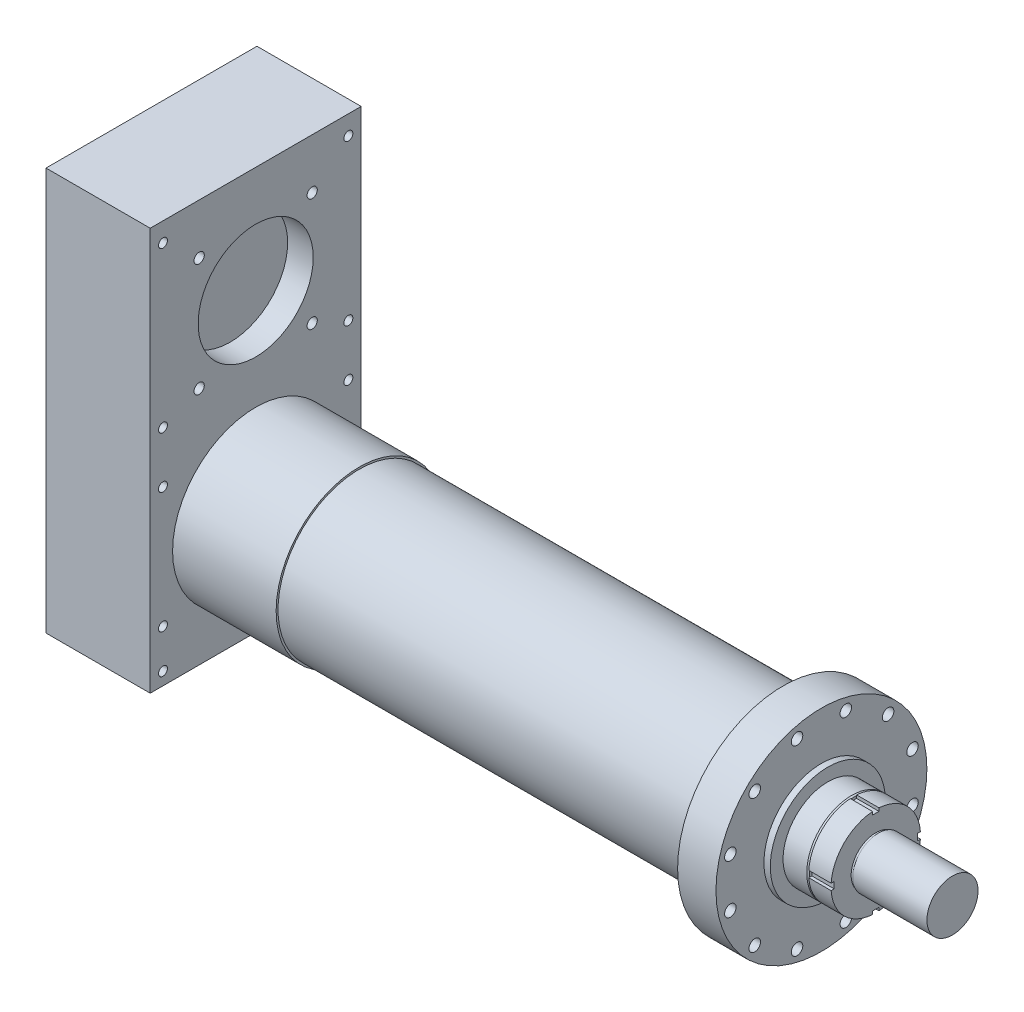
ISO-10303-21;
HEADER;
FILE_DESCRIPTION(('STEP AP214'),'2;1');
FILE_NAME('part.step','',(''),(''),'','','');
FILE_SCHEMA(('AUTOMOTIVE_DESIGN { 1 0 10303 214 1 1 1 1 }'));
ENDSEC;
DATA;
#1=APPLICATION_CONTEXT('core data for automotive mechanical design processes');
#2=APPLICATION_PROTOCOL_DEFINITION('international standard','automotive_design',2000,#1);
#3=PRODUCT_CONTEXT('',#1,'mechanical');
#4=PRODUCT('Part','Part','',(#3));
#5=PRODUCT_RELATED_PRODUCT_CATEGORY('part','',(#4));
#6=PRODUCT_DEFINITION_FORMATION('','',#4);
#7=PRODUCT_DEFINITION_CONTEXT('part definition',#1,'design');
#8=PRODUCT_DEFINITION('design','',#6,#7);
#9=PRODUCT_DEFINITION_SHAPE('','',#8);
#10=(LENGTH_UNIT() NAMED_UNIT(*) SI_UNIT(.MILLI.,.METRE.));
#11=(NAMED_UNIT(*) PLANE_ANGLE_UNIT() SI_UNIT($,.RADIAN.));
#12=(NAMED_UNIT(*) SI_UNIT($,.STERADIAN.) SOLID_ANGLE_UNIT());
#13=UNCERTAINTY_MEASURE_WITH_UNIT(LENGTH_MEASURE(1.E-05),#10,'distance_accuracy_value','');
#14=(GEOMETRIC_REPRESENTATION_CONTEXT(3) GLOBAL_UNCERTAINTY_ASSIGNED_CONTEXT((#13)) GLOBAL_UNIT_ASSIGNED_CONTEXT((#10,
#11,#12)) REPRESENTATION_CONTEXT('',''));
#15=CARTESIAN_POINT('',(0.,0.,0.));
#16=DIRECTION('',(0.,0.,1.));
#17=DIRECTION('',(1.,0.,0.));
#18=AXIS2_PLACEMENT_3D('',#15,#16,#17);
#19=CARTESIAN_POINT('',(-325.,455.,165.));
#20=DIRECTION('',(0.,0.,-1.));
#21=DIRECTION('',(0.,1.,0.));
#22=AXIS2_PLACEMENT_3D('',#19,#20,#21);
#23=PLANE('',#22);
#24=DIRECTION('',(0.,1.,0.));
#25=VECTOR('',#24,1.);
#26=CARTESIAN_POINT('',(-162.,455.,165.));
#27=LINE('',#26,#25);
#28=CARTESIAN_POINT('',(-162.,-175.,165.));
#29=VERTEX_POINT('',#28);
#30=CARTESIAN_POINT('',(-162.,455.,165.));
#31=VERTEX_POINT('',#30);
#32=EDGE_CURVE('E108',#29,#31,#27,.T.);
#33=ORIENTED_EDGE('',*,*,#32,.T.);
#34=DIRECTION('',(1.,0.,0.));
#35=VECTOR('',#34,1.);
#36=CARTESIAN_POINT('',(-325.,455.,165.));
#37=LINE('',#36,#35);
#38=CARTESIAN_POINT('',(-325.,455.,165.));
#39=VERTEX_POINT('',#38);
#40=EDGE_CURVE('E12',#39,#31,#37,.T.);
#41=ORIENTED_EDGE('',*,*,#40,.F.);
#42=DIRECTION('',(0.,1.,0.));
#43=VECTOR('',#42,1.);
#44=CARTESIAN_POINT('',(-325.,455.,165.));
#45=LINE('',#44,#43);
#46=CARTESIAN_POINT('',(-325.,-175.,165.));
#47=VERTEX_POINT('',#46);
#48=EDGE_CURVE('E96',#47,#39,#45,.T.);
#49=ORIENTED_EDGE('',*,*,#48,.F.);
#50=DIRECTION('',(1.,0.,0.));
#51=VECTOR('',#50,1.);
#52=CARTESIAN_POINT('',(-325.,-175.,165.));
#53=LINE('',#52,#51);
#54=EDGE_CURVE('E104',#47,#29,#53,.T.);
#55=ORIENTED_EDGE('',*,*,#54,.T.);
#56=EDGE_LOOP('',(#33,#41,#49,#55));
#57=FACE_BOUND('',#56,.T.);
#58=ADVANCED_FACE('F45',(#57),#23,.F.);
#59=CARTESIAN_POINT('',(-325.,455.,-165.));
#60=DIRECTION('',(0.,-1.,0.));
#61=DIRECTION('',(0.,0.,-1.));
#62=AXIS2_PLACEMENT_3D('',#59,#60,#61);
#63=PLANE('',#62);
#64=DIRECTION('',(0.,0.,-1.));
#65=VECTOR('',#64,1.);
#66=CARTESIAN_POINT('',(-162.,455.,-165.));
#67=LINE('',#66,#65);
#68=CARTESIAN_POINT('',(-162.,455.,-165.));
#69=VERTEX_POINT('',#68);
#70=EDGE_CURVE('E100',#31,#69,#67,.T.);
#71=ORIENTED_EDGE('',*,*,#70,.T.);
#72=DIRECTION('',(1.,0.,0.));
#73=VECTOR('',#72,1.);
#74=CARTESIAN_POINT('',(-325.,455.,-165.));
#75=LINE('',#74,#73);
#76=CARTESIAN_POINT('',(-325.,455.,-165.));
#77=VERTEX_POINT('',#76);
#78=EDGE_CURVE('E53',#77,#69,#75,.T.);
#79=ORIENTED_EDGE('',*,*,#78,.F.);
#80=DIRECTION('',(0.,0.,-1.));
#81=VECTOR('',#80,1.);
#82=CARTESIAN_POINT('',(-325.,455.,-165.));
#83=LINE('',#82,#81);
#84=EDGE_CURVE('E91',#39,#77,#83,.T.);
#85=ORIENTED_EDGE('',*,*,#84,.F.);
#86=ORIENTED_EDGE('',*,*,#40,.T.);
#87=EDGE_LOOP('',(#71,#79,#85,#86));
#88=FACE_BOUND('',#87,.T.);
#89=ADVANCED_FACE('F99',(#88),#63,.F.);
#90=CARTESIAN_POINT('',(-325.,455.,-165.));
#91=DIRECTION('',(0.,0.,1.));
#92=DIRECTION('',(0.,-1.,0.));
#93=AXIS2_PLACEMENT_3D('',#90,#91,#92);
#94=PLANE('',#93);
#95=DIRECTION('',(0.,-1.,0.));
#96=VECTOR('',#95,1.);
#97=CARTESIAN_POINT('',(-162.,455.,-165.));
#98=LINE('',#97,#96);
#99=CARTESIAN_POINT('',(-162.,-175.,-165.));
#100=VERTEX_POINT('',#99);
#101=EDGE_CURVE('E78',#69,#100,#98,.T.);
#102=ORIENTED_EDGE('',*,*,#101,.T.);
#103=DIRECTION('',(1.,0.,0.));
#104=VECTOR('',#103,1.);
#105=CARTESIAN_POINT('',(-325.,-175.,-165.));
#106=LINE('',#105,#104);
#107=CARTESIAN_POINT('',(-325.,-175.,-165.));
#108=VERTEX_POINT('',#107);
#109=EDGE_CURVE('E101',#108,#100,#106,.T.);
#110=ORIENTED_EDGE('',*,*,#109,.F.);
#111=DIRECTION('',(0.,-1.,0.));
#112=VECTOR('',#111,1.);
#113=CARTESIAN_POINT('',(-325.,455.,-165.));
#114=LINE('',#113,#112);
#115=EDGE_CURVE('E94',#77,#108,#114,.T.);
#116=ORIENTED_EDGE('',*,*,#115,.F.);
#117=ORIENTED_EDGE('',*,*,#78,.T.);
#118=EDGE_LOOP('',(#102,#110,#116,#117));
#119=FACE_BOUND('',#118,.T.);
#120=ADVANCED_FACE('F102',(#119),#94,.F.);
#121=CARTESIAN_POINT('',(-325.,-175.,-165.));
#122=DIRECTION('',(0.,1.,0.));
#123=DIRECTION('',(0.,0.,1.));
#124=AXIS2_PLACEMENT_3D('',#121,#122,#123);
#125=PLANE('',#124);
#126=DIRECTION('',(0.,0.,1.));
#127=VECTOR('',#126,1.);
#128=CARTESIAN_POINT('',(-162.,-175.,-165.));
#129=LINE('',#128,#127);
#130=EDGE_CURVE('E84',#100,#29,#129,.T.);
#131=ORIENTED_EDGE('',*,*,#130,.T.);
#132=ORIENTED_EDGE('',*,*,#54,.F.);
#133=DIRECTION('',(0.,0.,1.));
#134=VECTOR('',#133,1.);
#135=CARTESIAN_POINT('',(-325.,-175.,-165.));
#136=LINE('',#135,#134);
#137=EDGE_CURVE('E61',#108,#47,#136,.T.);
#138=ORIENTED_EDGE('',*,*,#137,.F.);
#139=ORIENTED_EDGE('',*,*,#109,.T.);
#140=EDGE_LOOP('',(#131,#132,#138,#139));
#141=FACE_BOUND('',#140,.T.);
#142=ADVANCED_FACE('F116',(#141),#125,.F.);
#143=CARTESIAN_POINT('',(-325.,0.,0.));
#144=DIRECTION('',(-1.,0.,0.));
#145=DIRECTION('',(0.,0.,1.));
#146=AXIS2_PLACEMENT_3D('',#143,#144,#145);
#147=PLANE('',#146);
#148=ORIENTED_EDGE('',*,*,#48,.T.);
#149=ORIENTED_EDGE('',*,*,#84,.T.);
#150=ORIENTED_EDGE('',*,*,#115,.T.);
#151=ORIENTED_EDGE('',*,*,#137,.T.);
#152=EDGE_LOOP('',(#148,#149,#150,#151));
#153=FACE_BOUND('',#152,.T.);
#154=ADVANCED_FACE('F92',(#153),#147,.T.);
#155=CARTESIAN_POINT('',(-162.,0.,0.));
#156=DIRECTION('',(-1.,0.,0.));
#157=DIRECTION('',(0.,0.,1.));
#158=AXIS2_PLACEMENT_3D('',#155,#156,#157);
#159=PLANE('',#158);
#160=CARTESIAN_POINT('',(-162.,-155.,145.));
#161=DIRECTION('',(1.,0.,0.));
#162=DIRECTION('',(0.,0.,-1.));
#163=AXIS2_PLACEMENT_3D('',#160,#161,#162);
#164=CIRCLE('',#163,7.00000000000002);
#165=CARTESIAN_POINT('',(-162.,-155.,138.));
#166=VERTEX_POINT('',#165);
#167=EDGE_CURVE('E152',#166,#166,#164,.T.);
#168=ORIENTED_EDGE('',*,*,#167,.F.);
#169=EDGE_LOOP('',(#168));
#170=FACE_BOUND('',#169,.T.);
#171=CARTESIAN_POINT('',(-162.,-94.5,145.));
#172=DIRECTION('',(1.,0.,0.));
#173=DIRECTION('',(0.,0.,-1.));
#174=AXIS2_PLACEMENT_3D('',#171,#172,#173);
#175=CIRCLE('',#174,7.00000000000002);
#176=CARTESIAN_POINT('',(-162.,-94.5,138.));
#177=VERTEX_POINT('',#176);
#178=EDGE_CURVE('E159',#177,#177,#175,.T.);
#179=ORIENTED_EDGE('',*,*,#178,.F.);
#180=EDGE_LOOP('',(#179));
#181=FACE_BOUND('',#180,.T.);
#182=CARTESIAN_POINT('',(-162.,94.5,145.));
#183=DIRECTION('',(1.,0.,0.));
#184=DIRECTION('',(0.,0.,-1.));
#185=AXIS2_PLACEMENT_3D('',#182,#183,#184);
#186=CIRCLE('',#185,7.00000000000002);
#187=CARTESIAN_POINT('',(-162.,94.5,138.));
#188=VERTEX_POINT('',#187);
#189=EDGE_CURVE('E165',#188,#188,#186,.T.);
#190=ORIENTED_EDGE('',*,*,#189,.F.);
#191=EDGE_LOOP('',(#190));
#192=FACE_BOUND('',#191,.T.);
#193=CARTESIAN_POINT('',(-162.,199.611652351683,88.3883476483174));
#194=DIRECTION('',(1.,0.,0.));
#195=DIRECTION('',(0.,0.,-1.));
#196=AXIS2_PLACEMENT_3D('',#193,#194,#195);
#197=CIRCLE('',#196,8.00000000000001);
#198=CARTESIAN_POINT('',(-162.,199.611652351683,80.3883476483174));
#199=VERTEX_POINT('',#198);
#200=EDGE_CURVE('E171',#199,#199,#197,.T.);
#201=ORIENTED_EDGE('',*,*,#200,.F.);
#202=EDGE_LOOP('',(#201));
#203=FACE_BOUND('',#202,.T.);
#204=CARTESIAN_POINT('',(-162.,199.611652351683,-88.3883476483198));
#205=DIRECTION('',(1.,0.,0.));
#206=DIRECTION('',(0.,0.,-1.));
#207=AXIS2_PLACEMENT_3D('',#204,#205,#206);
#208=CIRCLE('',#207,8.00000000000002);
#209=CARTESIAN_POINT('',(-162.,199.611652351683,-96.3883476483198));
#210=VERTEX_POINT('',#209);
#211=EDGE_CURVE('E128',#210,#210,#208,.T.);
#212=ORIENTED_EDGE('',*,*,#211,.F.);
#213=EDGE_LOOP('',(#212));
#214=FACE_BOUND('',#213,.T.);
#215=CARTESIAN_POINT('',(-162.,376.38834764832,-88.3883476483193));
#216=DIRECTION('',(1.,0.,0.));
#217=DIRECTION('',(0.,0.,-1.));
#218=AXIS2_PLACEMENT_3D('',#215,#216,#217);
#219=CIRCLE('',#218,7.99999999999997);
#220=CARTESIAN_POINT('',(-162.,376.38834764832,-96.3883476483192));
#221=VERTEX_POINT('',#220);
#222=EDGE_CURVE('E135',#221,#221,#219,.T.);
#223=ORIENTED_EDGE('',*,*,#222,.F.);
#224=EDGE_LOOP('',(#223));
#225=FACE_BOUND('',#224,.T.);
#226=CARTESIAN_POINT('',(-162.,175.,145.));
#227=DIRECTION('',(1.,0.,0.));
#228=DIRECTION('',(0.,0.,-1.));
#229=AXIS2_PLACEMENT_3D('',#226,#227,#228);
#230=CIRCLE('',#229,7.00000000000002);
#231=CARTESIAN_POINT('',(-162.,175.,138.));
#232=VERTEX_POINT('',#231);
#233=EDGE_CURVE('E141',#232,#232,#230,.T.);
#234=ORIENTED_EDGE('',*,*,#233,.F.);
#235=EDGE_LOOP('',(#234));
#236=FACE_BOUND('',#235,.T.);
#237=CARTESIAN_POINT('',(-162.,376.388347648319,88.3883476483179));
#238=DIRECTION('',(1.,0.,0.));
#239=DIRECTION('',(0.,0.,-1.));
#240=AXIS2_PLACEMENT_3D('',#237,#238,#239);
#241=CIRCLE('',#240,8.00000000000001);
#242=CARTESIAN_POINT('',(-162.,376.388347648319,80.3883476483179));
#243=VERTEX_POINT('',#242);
#244=EDGE_CURVE('E147',#243,#243,#241,.T.);
#245=ORIENTED_EDGE('',*,*,#244,.F.);
#246=EDGE_LOOP('',(#245));
#247=FACE_BOUND('',#246,.T.);
#248=CARTESIAN_POINT('',(-162.,425.,-145.));
#249=DIRECTION('',(1.,0.,0.));
#250=DIRECTION('',(0.,0.,1.));
#251=AXIS2_PLACEMENT_3D('',#248,#249,#250);
#252=CIRCLE('',#251,7.00000000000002);
#253=CARTESIAN_POINT('',(-162.,425.,-138.));
#254=VERTEX_POINT('',#253);
#255=EDGE_CURVE('E200',#254,#254,#252,.T.);
#256=ORIENTED_EDGE('',*,*,#255,.F.);
#257=EDGE_LOOP('',(#256));
#258=FACE_BOUND('',#257,.T.);
#259=CARTESIAN_POINT('',(-162.,175.,-145.));
#260=DIRECTION('',(1.,0.,0.));
#261=DIRECTION('',(0.,0.,1.));
#262=AXIS2_PLACEMENT_3D('',#259,#260,#261);
#263=CIRCLE('',#262,7.00000000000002);
#264=CARTESIAN_POINT('',(-162.,175.,-138.));
#265=VERTEX_POINT('',#264);
#266=EDGE_CURVE('E206',#265,#265,#263,.T.);
#267=ORIENTED_EDGE('',*,*,#266,.F.);
#268=EDGE_LOOP('',(#267));
#269=FACE_BOUND('',#268,.T.);
#270=CARTESIAN_POINT('',(-162.,425.,145.));
#271=DIRECTION('',(1.,0.,0.));
#272=DIRECTION('',(0.,0.,-1.));
#273=AXIS2_PLACEMENT_3D('',#270,#271,#272);
#274=CIRCLE('',#273,7.00000000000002);
#275=CARTESIAN_POINT('',(-162.,425.,138.));
#276=VERTEX_POINT('',#275);
#277=EDGE_CURVE('E183',#276,#276,#274,.T.);
#278=ORIENTED_EDGE('',*,*,#277,.F.);
#279=EDGE_LOOP('',(#278));
#280=FACE_BOUND('',#279,.T.);
#281=CARTESIAN_POINT('',(-162.,-155.,-145.));
#282=DIRECTION('',(1.,0.,0.));
#283=DIRECTION('',(0.,0.,1.));
#284=AXIS2_PLACEMENT_3D('',#281,#282,#283);
#285=CIRCLE('',#284,7.00000000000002);
#286=CARTESIAN_POINT('',(-162.,-155.,-138.));
#287=VERTEX_POINT('',#286);
#288=EDGE_CURVE('E176',#287,#287,#285,.T.);
#289=ORIENTED_EDGE('',*,*,#288,.F.);
#290=EDGE_LOOP('',(#289));
#291=FACE_BOUND('',#290,.T.);
#292=CARTESIAN_POINT('',(-162.,-94.5000000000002,-145.));
#293=DIRECTION('',(1.,0.,0.));
#294=DIRECTION('',(0.,0.,1.));
#295=AXIS2_PLACEMENT_3D('',#292,#293,#294);
#296=CIRCLE('',#295,7.00000000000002);
#297=CARTESIAN_POINT('',(-162.,-94.5000000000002,-138.));
#298=VERTEX_POINT('',#297);
#299=EDGE_CURVE('E195',#298,#298,#296,.T.);
#300=ORIENTED_EDGE('',*,*,#299,.F.);
#301=EDGE_LOOP('',(#300));
#302=FACE_BOUND('',#301,.T.);
#303=CARTESIAN_POINT('',(-162.,94.4999999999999,-145.));
#304=DIRECTION('',(1.,0.,0.));
#305=DIRECTION('',(0.,0.,1.));
#306=AXIS2_PLACEMENT_3D('',#303,#304,#305);
#307=CIRCLE('',#306,7.00000000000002);
#308=CARTESIAN_POINT('',(-162.,94.4999999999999,-138.));
#309=VERTEX_POINT('',#308);
#310=EDGE_CURVE('E188',#309,#309,#307,.T.);
#311=ORIENTED_EDGE('',*,*,#310,.F.);
#312=EDGE_LOOP('',(#311));
#313=FACE_BOUND('',#312,.T.);
#314=CARTESIAN_POINT('',(-162.,288.,0.));
#315=DIRECTION('',(1.,0.,0.));
#316=DIRECTION('',(0.,0.,-1.));
#317=AXIS2_PLACEMENT_3D('',#314,#315,#316);
#318=CIRCLE('',#317,90.);
#319=CARTESIAN_POINT('',(-162.,288.,-90.));
#320=VERTEX_POINT('',#319);
#321=EDGE_CURVE('E122',#320,#320,#318,.T.);
#322=ORIENTED_EDGE('',*,*,#321,.F.);
#323=EDGE_LOOP('',(#322));
#324=FACE_BOUND('',#323,.T.);
#325=ORIENTED_EDGE('',*,*,#32,.F.);
#326=ORIENTED_EDGE('',*,*,#130,.F.);
#327=ORIENTED_EDGE('',*,*,#101,.F.);
#328=ORIENTED_EDGE('',*,*,#70,.F.);
#329=EDGE_LOOP('',(#325,#326,#327,#328));
#330=FACE_BOUND('',#329,.T.);
#331=ADVANCED_FACE('F119',(#170,#181,#192,#203,#214,#225,#236,#247,#258,#269,#280,#291,#302,
#313,#324,#330),#159,.F.);
#332=CARTESIAN_POINT('',(-202.,288.,0.));
#333=DIRECTION('',(1.,0.,0.));
#334=DIRECTION('',(0.,0.,-1.));
#335=AXIS2_PLACEMENT_3D('',#332,#333,#334);
#336=CYLINDRICAL_SURFACE('',#335,90.);
#337=CARTESIAN_POINT('',(-202.,288.,0.));
#338=DIRECTION('',(1.,0.,0.));
#339=DIRECTION('',(0.,0.,-1.));
#340=AXIS2_PLACEMENT_3D('',#337,#338,#339);
#341=CIRCLE('',#340,90.);
#342=CARTESIAN_POINT('',(-202.,288.,-90.));
#343=VERTEX_POINT('',#342);
#344=EDGE_CURVE('E111',#343,#343,#341,.T.);
#345=ORIENTED_EDGE('',*,*,#344,.F.);
#346=EDGE_LOOP('',(#345));
#347=FACE_BOUND('',#346,.T.);
#348=ORIENTED_EDGE('',*,*,#321,.T.);
#349=EDGE_LOOP('',(#348));
#350=FACE_BOUND('',#349,.T.);
#351=ADVANCED_FACE('F223',(#347,#350),#336,.F.);
#352=CARTESIAN_POINT('',(-202.,288.,0.));
#353=DIRECTION('',(1.,0.,0.));
#354=DIRECTION('',(0.,0.,-1.));
#355=AXIS2_PLACEMENT_3D('',#352,#353,#354);
#356=PLANE('',#355);
#357=ORIENTED_EDGE('',*,*,#344,.T.);
#358=EDGE_LOOP('',(#357));
#359=FACE_BOUND('',#358,.T.);
#360=ADVANCED_FACE('F237',(#359),#356,.T.);
#361=CARTESIAN_POINT('',(-202.,94.4999999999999,-145.));
#362=DIRECTION('',(1.,0.,0.));
#363=DIRECTION('',(0.,0.,-1.));
#364=AXIS2_PLACEMENT_3D('',#361,#362,#363);
#365=CYLINDRICAL_SURFACE('',#364,7.00000000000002);
#366=CARTESIAN_POINT('',(-202.,94.4999999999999,-145.));
#367=DIRECTION('',(1.,0.,0.));
#368=DIRECTION('',(0.,0.,1.));
#369=AXIS2_PLACEMENT_3D('',#366,#367,#368);
#370=CIRCLE('',#369,7.00000000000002);
#371=CARTESIAN_POINT('',(-202.,94.4999999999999,-138.));
#372=VERTEX_POINT('',#371);
#373=EDGE_CURVE('E191',#372,#372,#370,.T.);
#374=ORIENTED_EDGE('',*,*,#373,.F.);
#375=EDGE_LOOP('',(#374));
#376=FACE_BOUND('',#375,.T.);
#377=ORIENTED_EDGE('',*,*,#310,.T.);
#378=EDGE_LOOP('',(#377));
#379=FACE_BOUND('',#378,.T.);
#380=ADVANCED_FACE('F243',(#376,#379),#365,.F.);
#381=CARTESIAN_POINT('',(-202.,94.4999999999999,-145.));
#382=DIRECTION('',(-1.,0.,0.));
#383=DIRECTION('',(0.,0.,1.));
#384=AXIS2_PLACEMENT_3D('',#381,#382,#383);
#385=PLANE('',#384);
#386=ORIENTED_EDGE('',*,*,#373,.T.);
#387=EDGE_LOOP('',(#386));
#388=FACE_BOUND('',#387,.T.);
#389=ADVANCED_FACE('F286',(#388),#385,.F.);
#390=CARTESIAN_POINT('',(-202.,-94.5000000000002,-145.));
#391=DIRECTION('',(1.,0.,0.));
#392=DIRECTION('',(0.,0.,-1.));
#393=AXIS2_PLACEMENT_3D('',#390,#391,#392);
#394=CYLINDRICAL_SURFACE('',#393,7.00000000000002);
#395=CARTESIAN_POINT('',(-202.,-94.5000000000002,-145.));
#396=DIRECTION('',(1.,0.,0.));
#397=DIRECTION('',(0.,0.,1.));
#398=AXIS2_PLACEMENT_3D('',#395,#396,#397);
#399=CIRCLE('',#398,7.00000000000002);
#400=CARTESIAN_POINT('',(-202.,-94.5000000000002,-138.));
#401=VERTEX_POINT('',#400);
#402=EDGE_CURVE('E180',#401,#401,#399,.T.);
#403=ORIENTED_EDGE('',*,*,#402,.F.);
#404=EDGE_LOOP('',(#403));
#405=FACE_BOUND('',#404,.T.);
#406=ORIENTED_EDGE('',*,*,#299,.T.);
#407=EDGE_LOOP('',(#406));
#408=FACE_BOUND('',#407,.T.);
#409=ADVANCED_FACE('F296',(#405,#408),#394,.F.);
#410=CARTESIAN_POINT('',(-202.,-94.5000000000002,-145.));
#411=DIRECTION('',(-1.,0.,0.));
#412=DIRECTION('',(0.,0.,1.));
#413=AXIS2_PLACEMENT_3D('',#410,#411,#412);
#414=PLANE('',#413);
#415=ORIENTED_EDGE('',*,*,#402,.T.);
#416=EDGE_LOOP('',(#415));
#417=FACE_BOUND('',#416,.T.);
#418=ADVANCED_FACE('F306',(#417),#414,.F.);
#419=CARTESIAN_POINT('',(-202.,-155.,-145.));
#420=DIRECTION('',(1.,0.,0.));
#421=DIRECTION('',(0.,0.,-1.));
#422=AXIS2_PLACEMENT_3D('',#419,#420,#421);
#423=CYLINDRICAL_SURFACE('',#422,7.00000000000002);
#424=CARTESIAN_POINT('',(-202.,-155.,-145.));
#425=DIRECTION('',(1.,0.,0.));
#426=DIRECTION('',(0.,0.,1.));
#427=AXIS2_PLACEMENT_3D('',#424,#425,#426);
#428=CIRCLE('',#427,7.00000000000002);
#429=CARTESIAN_POINT('',(-202.,-155.,-138.));
#430=VERTEX_POINT('',#429);
#431=EDGE_CURVE('E179',#430,#430,#428,.T.);
#432=ORIENTED_EDGE('',*,*,#431,.F.);
#433=EDGE_LOOP('',(#432));
#434=FACE_BOUND('',#433,.T.);
#435=ORIENTED_EDGE('',*,*,#288,.T.);
#436=EDGE_LOOP('',(#435));
#437=FACE_BOUND('',#436,.T.);
#438=ADVANCED_FACE('F316',(#434,#437),#423,.F.);
#439=CARTESIAN_POINT('',(-202.,-155.,-145.));
#440=DIRECTION('',(-1.,0.,0.));
#441=DIRECTION('',(0.,0.,1.));
#442=AXIS2_PLACEMENT_3D('',#439,#440,#441);
#443=PLANE('',#442);
#444=ORIENTED_EDGE('',*,*,#431,.T.);
#445=EDGE_LOOP('',(#444));
#446=FACE_BOUND('',#445,.T.);
#447=ADVANCED_FACE('F326',(#446),#443,.F.);
#448=CARTESIAN_POINT('',(-202.,425.,145.));
#449=DIRECTION('',(1.,0.,0.));
#450=DIRECTION('',(0.,0.,-1.));
#451=AXIS2_PLACEMENT_3D('',#448,#449,#450);
#452=CYLINDRICAL_SURFACE('',#451,7.00000000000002);
#453=CARTESIAN_POINT('',(-202.,425.,145.));
#454=DIRECTION('',(1.,0.,0.));
#455=DIRECTION('',(0.,0.,-1.));
#456=AXIS2_PLACEMENT_3D('',#453,#454,#455);
#457=CIRCLE('',#456,7.00000000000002);
#458=CARTESIAN_POINT('',(-202.,425.,138.));
#459=VERTEX_POINT('',#458);
#460=EDGE_CURVE('E156',#459,#459,#457,.T.);
#461=ORIENTED_EDGE('',*,*,#460,.F.);
#462=EDGE_LOOP('',(#461));
#463=FACE_BOUND('',#462,.T.);
#464=ORIENTED_EDGE('',*,*,#277,.T.);
#465=EDGE_LOOP('',(#464));
#466=FACE_BOUND('',#465,.T.);
#467=ADVANCED_FACE('F336',(#463,#466),#452,.F.);
#468=CARTESIAN_POINT('',(-202.,425.,145.));
#469=DIRECTION('',(1.,0.,0.));
#470=DIRECTION('',(0.,0.,-1.));
#471=AXIS2_PLACEMENT_3D('',#468,#469,#470);
#472=PLANE('',#471);
#473=ORIENTED_EDGE('',*,*,#460,.T.);
#474=EDGE_LOOP('',(#473));
#475=FACE_BOUND('',#474,.T.);
#476=ADVANCED_FACE('F217',(#475),#472,.T.);
#477=CARTESIAN_POINT('',(-202.,175.,-145.));
#478=DIRECTION('',(1.,0.,0.));
#479=DIRECTION('',(0.,0.,-1.));
#480=AXIS2_PLACEMENT_3D('',#477,#478,#479);
#481=CYLINDRICAL_SURFACE('',#480,7.00000000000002);
#482=CARTESIAN_POINT('',(-202.,175.,-145.));
#483=DIRECTION('',(1.,0.,0.));
#484=DIRECTION('',(0.,0.,1.));
#485=AXIS2_PLACEMENT_3D('',#482,#483,#484);
#486=CIRCLE('',#485,7.00000000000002);
#487=CARTESIAN_POINT('',(-202.,175.,-138.));
#488=VERTEX_POINT('',#487);
#489=EDGE_CURVE('E192',#488,#488,#486,.T.);
#490=ORIENTED_EDGE('',*,*,#489,.F.);
#491=EDGE_LOOP('',(#490));
#492=FACE_BOUND('',#491,.T.);
#493=ORIENTED_EDGE('',*,*,#266,.T.);
#494=EDGE_LOOP('',(#493));
#495=FACE_BOUND('',#494,.T.);
#496=ADVANCED_FACE('F214',(#492,#495),#481,.F.);
#497=CARTESIAN_POINT('',(-202.,175.,-145.));
#498=DIRECTION('',(-1.,0.,0.));
#499=DIRECTION('',(0.,0.,1.));
#500=AXIS2_PLACEMENT_3D('',#497,#498,#499);
#501=PLANE('',#500);
#502=ORIENTED_EDGE('',*,*,#489,.T.);
#503=EDGE_LOOP('',(#502));
#504=FACE_BOUND('',#503,.T.);
#505=ADVANCED_FACE('F212',(#504),#501,.F.);
#506=CARTESIAN_POINT('',(-202.,425.,-145.));
#507=DIRECTION('',(1.,0.,0.));
#508=DIRECTION('',(0.,0.,-1.));
#509=AXIS2_PLACEMENT_3D('',#506,#507,#508);
#510=CYLINDRICAL_SURFACE('',#509,7.00000000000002);
#511=CARTESIAN_POINT('',(-202.,425.,-145.));
#512=DIRECTION('',(1.,0.,0.));
#513=DIRECTION('',(0.,0.,1.));
#514=AXIS2_PLACEMENT_3D('',#511,#512,#513);
#515=CIRCLE('',#514,7.00000000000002);
#516=CARTESIAN_POINT('',(-202.,425.,-138.));
#517=VERTEX_POINT('',#516);
#518=EDGE_CURVE('E203',#517,#517,#515,.T.);
#519=ORIENTED_EDGE('',*,*,#518,.F.);
#520=EDGE_LOOP('',(#519));
#521=FACE_BOUND('',#520,.T.);
#522=ORIENTED_EDGE('',*,*,#255,.T.);
#523=EDGE_LOOP('',(#522));
#524=FACE_BOUND('',#523,.T.);
#525=ADVANCED_FACE('F370',(#521,#524),#510,.F.);
#526=CARTESIAN_POINT('',(-202.,425.,-145.));
#527=DIRECTION('',(-1.,0.,0.));
#528=DIRECTION('',(0.,0.,1.));
#529=AXIS2_PLACEMENT_3D('',#526,#527,#528);
#530=PLANE('',#529);
#531=ORIENTED_EDGE('',*,*,#518,.T.);
#532=EDGE_LOOP('',(#531));
#533=FACE_BOUND('',#532,.T.);
#534=ADVANCED_FACE('F379',(#533),#530,.F.);
#535=CARTESIAN_POINT('',(-202.,376.388347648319,88.3883476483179));
#536=DIRECTION('',(1.,0.,0.));
#537=DIRECTION('',(0.,0.,-1.));
#538=AXIS2_PLACEMENT_3D('',#535,#536,#537);
#539=CYLINDRICAL_SURFACE('',#538,8.00000000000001);
#540=CARTESIAN_POINT('',(-202.,376.388347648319,88.3883476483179));
#541=DIRECTION('',(1.,0.,0.));
#542=DIRECTION('',(0.,0.,-1.));
#543=AXIS2_PLACEMENT_3D('',#540,#541,#542);
#544=CIRCLE('',#543,8.00000000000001);
#545=CARTESIAN_POINT('',(-202.,376.388347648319,80.3883476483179));
#546=VERTEX_POINT('',#545);
#547=EDGE_CURVE('E125',#546,#546,#544,.T.);
#548=ORIENTED_EDGE('',*,*,#547,.F.);
#549=EDGE_LOOP('',(#548));
#550=FACE_BOUND('',#549,.T.);
#551=ORIENTED_EDGE('',*,*,#244,.T.);
#552=EDGE_LOOP('',(#551));
#553=FACE_BOUND('',#552,.T.);
#554=ADVANCED_FACE('F389',(#550,#553),#539,.F.);
#555=CARTESIAN_POINT('',(-202.,376.388347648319,88.3883476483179));
#556=DIRECTION('',(1.,0.,0.));
#557=DIRECTION('',(0.,0.,-1.));
#558=AXIS2_PLACEMENT_3D('',#555,#556,#557);
#559=PLANE('',#558);
#560=ORIENTED_EDGE('',*,*,#547,.T.);
#561=EDGE_LOOP('',(#560));
#562=FACE_BOUND('',#561,.T.);
#563=ADVANCED_FACE('F399',(#562),#559,.T.);
#564=CARTESIAN_POINT('',(-202.,175.,145.));
#565=DIRECTION('',(1.,0.,0.));
#566=DIRECTION('',(0.,0.,-1.));
#567=AXIS2_PLACEMENT_3D('',#564,#565,#566);
#568=CYLINDRICAL_SURFACE('',#567,7.00000000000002);
#569=CARTESIAN_POINT('',(-202.,175.,145.));
#570=DIRECTION('',(1.,0.,0.));
#571=DIRECTION('',(0.,0.,-1.));
#572=AXIS2_PLACEMENT_3D('',#569,#570,#571);
#573=CIRCLE('',#572,7.00000000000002);
#574=CARTESIAN_POINT('',(-202.,175.,138.));
#575=VERTEX_POINT('',#574);
#576=EDGE_CURVE('E144',#575,#575,#573,.T.);
#577=ORIENTED_EDGE('',*,*,#576,.F.);
#578=EDGE_LOOP('',(#577));
#579=FACE_BOUND('',#578,.T.);
#580=ORIENTED_EDGE('',*,*,#233,.T.);
#581=EDGE_LOOP('',(#580));
#582=FACE_BOUND('',#581,.T.);
#583=ADVANCED_FACE('F409',(#579,#582),#568,.F.);
#584=CARTESIAN_POINT('',(-202.,175.,145.));
#585=DIRECTION('',(1.,0.,0.));
#586=DIRECTION('',(0.,0.,-1.));
#587=AXIS2_PLACEMENT_3D('',#584,#585,#586);
#588=PLANE('',#587);
#589=ORIENTED_EDGE('',*,*,#576,.T.);
#590=EDGE_LOOP('',(#589));
#591=FACE_BOUND('',#590,.T.);
#592=ADVANCED_FACE('F419',(#591),#588,.T.);
#593=CARTESIAN_POINT('',(-202.,376.38834764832,-88.3883476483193));
#594=DIRECTION('',(1.,0.,0.));
#595=DIRECTION('',(0.,0.,-1.));
#596=AXIS2_PLACEMENT_3D('',#593,#594,#595);
#597=CYLINDRICAL_SURFACE('',#596,7.99999999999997);
#598=CARTESIAN_POINT('',(-202.,376.38834764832,-88.3883476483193));
#599=DIRECTION('',(1.,0.,0.));
#600=DIRECTION('',(0.,0.,-1.));
#601=AXIS2_PLACEMENT_3D('',#598,#599,#600);
#602=CIRCLE('',#601,7.99999999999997);
#603=CARTESIAN_POINT('',(-202.,376.38834764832,-96.3883476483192));
#604=VERTEX_POINT('',#603);
#605=EDGE_CURVE('E138',#604,#604,#602,.T.);
#606=ORIENTED_EDGE('',*,*,#605,.F.);
#607=EDGE_LOOP('',(#606));
#608=FACE_BOUND('',#607,.T.);
#609=ORIENTED_EDGE('',*,*,#222,.T.);
#610=EDGE_LOOP('',(#609));
#611=FACE_BOUND('',#610,.T.);
#612=ADVANCED_FACE('F429',(#608,#611),#597,.F.);
#613=CARTESIAN_POINT('',(-202.,376.38834764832,-88.3883476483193));
#614=DIRECTION('',(1.,0.,0.));
#615=DIRECTION('',(0.,0.,-1.));
#616=AXIS2_PLACEMENT_3D('',#613,#614,#615);
#617=PLANE('',#616);
#618=ORIENTED_EDGE('',*,*,#605,.T.);
#619=EDGE_LOOP('',(#618));
#620=FACE_BOUND('',#619,.T.);
#621=ADVANCED_FACE('F439',(#620),#617,.T.);
#622=CARTESIAN_POINT('',(-202.,199.611652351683,-88.3883476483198));
#623=DIRECTION('',(1.,0.,0.));
#624=DIRECTION('',(0.,0.,-1.));
#625=AXIS2_PLACEMENT_3D('',#622,#623,#624);
#626=CYLINDRICAL_SURFACE('',#625,8.00000000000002);
#627=CARTESIAN_POINT('',(-202.,199.611652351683,-88.3883476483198));
#628=DIRECTION('',(1.,0.,0.));
#629=DIRECTION('',(0.,0.,-1.));
#630=AXIS2_PLACEMENT_3D('',#627,#628,#629);
#631=CIRCLE('',#630,8.00000000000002);
#632=CARTESIAN_POINT('',(-202.,199.611652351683,-96.3883476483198));
#633=VERTEX_POINT('',#632);
#634=EDGE_CURVE('E131',#633,#633,#631,.T.);
#635=ORIENTED_EDGE('',*,*,#634,.F.);
#636=EDGE_LOOP('',(#635));
#637=FACE_BOUND('',#636,.T.);
#638=ORIENTED_EDGE('',*,*,#211,.T.);
#639=EDGE_LOOP('',(#638));
#640=FACE_BOUND('',#639,.T.);
#641=ADVANCED_FACE('F449',(#637,#640),#626,.F.);
#642=CARTESIAN_POINT('',(-202.,199.611652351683,-88.3883476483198));
#643=DIRECTION('',(1.,0.,0.));
#644=DIRECTION('',(0.,0.,-1.));
#645=AXIS2_PLACEMENT_3D('',#642,#643,#644);
#646=PLANE('',#645);
#647=ORIENTED_EDGE('',*,*,#634,.T.);
#648=EDGE_LOOP('',(#647));
#649=FACE_BOUND('',#648,.T.);
#650=ADVANCED_FACE('F459',(#649),#646,.T.);
#651=CARTESIAN_POINT('',(-202.,199.611652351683,88.3883476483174));
#652=DIRECTION('',(1.,0.,0.));
#653=DIRECTION('',(0.,0.,-1.));
#654=AXIS2_PLACEMENT_3D('',#651,#652,#653);
#655=CYLINDRICAL_SURFACE('',#654,8.00000000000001);
#656=CARTESIAN_POINT('',(-202.,199.611652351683,88.3883476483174));
#657=DIRECTION('',(1.,0.,0.));
#658=DIRECTION('',(0.,0.,-1.));
#659=AXIS2_PLACEMENT_3D('',#656,#657,#658);
#660=CIRCLE('',#659,8.00000000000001);
#661=CARTESIAN_POINT('',(-202.,199.611652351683,80.3883476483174));
#662=VERTEX_POINT('',#661);
#663=EDGE_CURVE('E132',#662,#662,#660,.T.);
#664=ORIENTED_EDGE('',*,*,#663,.F.);
#665=EDGE_LOOP('',(#664));
#666=FACE_BOUND('',#665,.T.);
#667=ORIENTED_EDGE('',*,*,#200,.T.);
#668=EDGE_LOOP('',(#667));
#669=FACE_BOUND('',#668,.T.);
#670=ADVANCED_FACE('F469',(#666,#669),#655,.F.);
#671=CARTESIAN_POINT('',(-202.,199.611652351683,88.3883476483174));
#672=DIRECTION('',(1.,0.,0.));
#673=DIRECTION('',(0.,0.,-1.));
#674=AXIS2_PLACEMENT_3D('',#671,#672,#673);
#675=PLANE('',#674);
#676=ORIENTED_EDGE('',*,*,#663,.T.);
#677=EDGE_LOOP('',(#676));
#678=FACE_BOUND('',#677,.T.);
#679=ADVANCED_FACE('F479',(#678),#675,.T.);
#680=CARTESIAN_POINT('',(-202.,94.5,145.));
#681=DIRECTION('',(1.,0.,0.));
#682=DIRECTION('',(0.,0.,-1.));
#683=AXIS2_PLACEMENT_3D('',#680,#681,#682);
#684=CYLINDRICAL_SURFACE('',#683,7.00000000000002);
#685=CARTESIAN_POINT('',(-202.,94.5,145.));
#686=DIRECTION('',(1.,0.,0.));
#687=DIRECTION('',(0.,0.,-1.));
#688=AXIS2_PLACEMENT_3D('',#685,#686,#687);
#689=CIRCLE('',#688,7.00000000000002);
#690=CARTESIAN_POINT('',(-202.,94.5,138.));
#691=VERTEX_POINT('',#690);
#692=EDGE_CURVE('E168',#691,#691,#689,.T.);
#693=ORIENTED_EDGE('',*,*,#692,.F.);
#694=EDGE_LOOP('',(#693));
#695=FACE_BOUND('',#694,.T.);
#696=ORIENTED_EDGE('',*,*,#189,.T.);
#697=EDGE_LOOP('',(#696));
#698=FACE_BOUND('',#697,.T.);
#699=ADVANCED_FACE('F489',(#695,#698),#684,.F.);
#700=CARTESIAN_POINT('',(-202.,94.5,145.));
#701=DIRECTION('',(1.,0.,0.));
#702=DIRECTION('',(0.,0.,-1.));
#703=AXIS2_PLACEMENT_3D('',#700,#701,#702);
#704=PLANE('',#703);
#705=ORIENTED_EDGE('',*,*,#692,.T.);
#706=EDGE_LOOP('',(#705));
#707=FACE_BOUND('',#706,.T.);
#708=ADVANCED_FACE('F499',(#707),#704,.T.);
#709=CARTESIAN_POINT('',(-202.,-94.5,145.));
#710=DIRECTION('',(1.,0.,0.));
#711=DIRECTION('',(0.,0.,-1.));
#712=AXIS2_PLACEMENT_3D('',#709,#710,#711);
#713=CYLINDRICAL_SURFACE('',#712,7.00000000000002);
#714=CARTESIAN_POINT('',(-202.,-94.5,145.));
#715=DIRECTION('',(1.,0.,0.));
#716=DIRECTION('',(0.,0.,-1.));
#717=AXIS2_PLACEMENT_3D('',#714,#715,#716);
#718=CIRCLE('',#717,7.00000000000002);
#719=CARTESIAN_POINT('',(-202.,-94.5,138.));
#720=VERTEX_POINT('',#719);
#721=EDGE_CURVE('E162',#720,#720,#718,.T.);
#722=ORIENTED_EDGE('',*,*,#721,.F.);
#723=EDGE_LOOP('',(#722));
#724=FACE_BOUND('',#723,.T.);
#725=ORIENTED_EDGE('',*,*,#178,.T.);
#726=EDGE_LOOP('',(#725));
#727=FACE_BOUND('',#726,.T.);
#728=ADVANCED_FACE('F509',(#724,#727),#713,.F.);
#729=CARTESIAN_POINT('',(-202.,-94.5,145.));
#730=DIRECTION('',(1.,0.,0.));
#731=DIRECTION('',(0.,0.,-1.));
#732=AXIS2_PLACEMENT_3D('',#729,#730,#731);
#733=PLANE('',#732);
#734=ORIENTED_EDGE('',*,*,#721,.T.);
#735=EDGE_LOOP('',(#734));
#736=FACE_BOUND('',#735,.T.);
#737=ADVANCED_FACE('F519',(#736),#733,.T.);
#738=CARTESIAN_POINT('',(-202.,-155.,145.));
#739=DIRECTION('',(1.,0.,0.));
#740=DIRECTION('',(0.,0.,-1.));
#741=AXIS2_PLACEMENT_3D('',#738,#739,#740);
#742=CYLINDRICAL_SURFACE('',#741,7.00000000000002);
#743=CARTESIAN_POINT('',(-202.,-155.,145.));
#744=DIRECTION('',(1.,0.,0.));
#745=DIRECTION('',(0.,0.,-1.));
#746=AXIS2_PLACEMENT_3D('',#743,#744,#745);
#747=CIRCLE('',#746,7.00000000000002);
#748=CARTESIAN_POINT('',(-202.,-155.,138.));
#749=VERTEX_POINT('',#748);
#750=EDGE_CURVE('E155',#749,#749,#747,.T.);
#751=ORIENTED_EDGE('',*,*,#750,.F.);
#752=EDGE_LOOP('',(#751));
#753=FACE_BOUND('',#752,.T.);
#754=ORIENTED_EDGE('',*,*,#167,.T.);
#755=EDGE_LOOP('',(#754));
#756=FACE_BOUND('',#755,.T.);
#757=ADVANCED_FACE('F529',(#753,#756),#742,.F.);
#758=CARTESIAN_POINT('',(-202.,-155.,145.));
#759=DIRECTION('',(1.,0.,0.));
#760=DIRECTION('',(0.,0.,-1.));
#761=AXIS2_PLACEMENT_3D('',#758,#759,#760);
#762=PLANE('',#761);
#763=ORIENTED_EDGE('',*,*,#750,.T.);
#764=EDGE_LOOP('',(#763));
#765=FACE_BOUND('',#764,.T.);
#766=ADVANCED_FACE('F539',(#765),#762,.T.);
#767=CLOSED_SHELL('',(#58,#89,#120,#142,#154,#331,#351,#360,#380,#389,#409,#418,#438,#447,#467,
#476,#496,#505,#525,#534,#554,#563,#583,#592,#612,#621,#641,#650,#670,#679,#699,#708,#728,#737,
#757,#766));
#768=MANIFOLD_SOLID_BREP('B2',#767);
#769=CARTESIAN_POINT('',(-162.,0.,0.));
#770=DIRECTION('',(1.,0.,0.));
#771=DIRECTION('',(0.,0.,-1.));
#772=AXIS2_PLACEMENT_3D('',#769,#770,#771);
#773=CYLINDRICAL_SURFACE('',#772,130.);
#774=CARTESIAN_POINT('',(-162.,0.,0.));
#775=DIRECTION('',(-1.,0.,0.));
#776=DIRECTION('',(0.,0.,1.));
#777=AXIS2_PLACEMENT_3D('',#774,#775,#776);
#778=CIRCLE('',#777,130.);
#779=CARTESIAN_POINT('',(-162.,0.,130.));
#780=VERTEX_POINT('',#779);
#781=EDGE_CURVE('E44',#780,#780,#778,.T.);
#782=ORIENTED_EDGE('',*,*,#781,.F.);
#783=EDGE_LOOP('',(#782));
#784=FACE_BOUND('',#783,.T.);
#785=CARTESIAN_POINT('',(0.,0.,0.));
#786=DIRECTION('',(-1.,0.,0.));
#787=DIRECTION('',(0.,0.,1.));
#788=AXIS2_PLACEMENT_3D('',#785,#786,#787);
#789=CIRCLE('',#788,130.);
#790=CARTESIAN_POINT('',(0.,0.,130.));
#791=VERTEX_POINT('',#790);
#792=EDGE_CURVE('E631',#791,#791,#789,.T.);
#793=ORIENTED_EDGE('',*,*,#792,.T.);
#794=EDGE_LOOP('',(#793));
#795=FACE_BOUND('',#794,.T.);
#796=ADVANCED_FACE('F628',(#784,#795),#773,.T.);
#797=CARTESIAN_POINT('',(-162.,0.,0.));
#798=DIRECTION('',(-1.,0.,0.));
#799=DIRECTION('',(0.,0.,1.));
#800=AXIS2_PLACEMENT_3D('',#797,#798,#799);
#801=PLANE('',#800);
#802=ORIENTED_EDGE('',*,*,#781,.T.);
#803=EDGE_LOOP('',(#802));
#804=FACE_BOUND('',#803,.T.);
#805=ADVANCED_FACE('F643',(#804),#801,.T.);
#806=CARTESIAN_POINT('',(0.,0.,0.));
#807=DIRECTION('',(-1.,0.,0.));
#808=DIRECTION('',(0.,0.,1.));
#809=AXIS2_PLACEMENT_3D('',#806,#807,#808);
#810=PLANE('',#809);
#811=ORIENTED_EDGE('',*,*,#792,.F.);
#812=EDGE_LOOP('',(#811));
#813=FACE_BOUND('',#812,.T.);
#814=ADVANCED_FACE('F641',(#813),#810,.F.);
#815=CLOSED_SHELL('',(#796,#805,#814));
#816=MANIFOLD_SOLID_BREP('B6',#815);
#817=CARTESIAN_POINT('',(808.,0.,0.));
#818=DIRECTION('',(-1.,0.,0.));
#819=DIRECTION('',(0.,0.,1.));
#820=AXIS2_PLACEMENT_3D('',#817,#818,#819);
#821=CYLINDRICAL_SURFACE('',#820,70.);
#822=DIRECTION('',(-1.,0.,0.));
#823=VECTOR('',#822,1.);
#824=CARTESIAN_POINT('',(808.,69.8212002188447,5.));
#825=LINE('',#824,#823);
#826=CARTESIAN_POINT('',(773.,69.8212002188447,5.));
#827=VERTEX_POINT('',#826);
#828=CARTESIAN_POINT('',(808.,69.8212002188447,5.));
#829=VERTEX_POINT('',#828);
#830=EDGE_CURVE('E916',#827,#829,#825,.F.);
#831=ORIENTED_EDGE('',*,*,#830,.F.);
#832=CARTESIAN_POINT('',(773.,0.,0.));
#833=DIRECTION('',(1.,0.,0.));
#834=DIRECTION('',(0.,0.,-1.));
#835=AXIS2_PLACEMENT_3D('',#832,#833,#834);
#836=CIRCLE('',#835,70.);
#837=CARTESIAN_POINT('',(773.,5.,69.8212002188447));
#838=VERTEX_POINT('',#837);
#839=EDGE_CURVE('E942',#827,#838,#836,.T.);
#840=ORIENTED_EDGE('',*,*,#839,.T.);
#841=DIRECTION('',(-1.,0.,0.));
#842=VECTOR('',#841,1.);
#843=CARTESIAN_POINT('',(808.,5.,69.8212002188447));
#844=LINE('',#843,#842);
#845=CARTESIAN_POINT('',(808.,5.,69.8212002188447));
#846=VERTEX_POINT('',#845);
#847=EDGE_CURVE('E905',#846,#838,#844,.T.);
#848=ORIENTED_EDGE('',*,*,#847,.F.);
#849=CARTESIAN_POINT('',(808.,0.,0.));
#850=DIRECTION('',(1.,0.,0.));
#851=DIRECTION('',(0.,0.,-1.));
#852=AXIS2_PLACEMENT_3D('',#849,#850,#851);
#853=CIRCLE('',#852,70.);
#854=EDGE_CURVE('E937',#829,#846,#853,.T.);
#855=ORIENTED_EDGE('',*,*,#854,.F.);
#856=EDGE_LOOP('',(#831,#840,#848,#855));
#857=FACE_BOUND('',#856,.T.);
#858=ADVANCED_FACE('F675',(#857),#821,.T.);
#859=CARTESIAN_POINT('',(773.,5.,-69.8212002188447));
#860=VERTEX_POINT('',#859);
#861=CARTESIAN_POINT('',(773.,69.8212002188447,-5.));
#862=VERTEX_POINT('',#861);
#863=EDGE_CURVE('E939',#860,#862,#836,.T.);
#864=ORIENTED_EDGE('',*,*,#863,.T.);
#865=DIRECTION('',(-1.,0.,0.));
#866=VECTOR('',#865,1.);
#867=CARTESIAN_POINT('',(808.,69.8212002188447,-5.));
#868=LINE('',#867,#866);
#869=CARTESIAN_POINT('',(808.,69.8212002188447,-5.));
#870=VERTEX_POINT('',#869);
#871=EDGE_CURVE('E698',#862,#870,#868,.F.);
#872=ORIENTED_EDGE('',*,*,#871,.T.);
#873=CARTESIAN_POINT('',(808.,5.,-69.8212002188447));
#874=VERTEX_POINT('',#873);
#875=EDGE_CURVE('E933',#874,#870,#853,.T.);
#876=ORIENTED_EDGE('',*,*,#875,.F.);
#877=DIRECTION('',(-1.,0.,0.));
#878=VECTOR('',#877,1.);
#879=CARTESIAN_POINT('',(808.,5.,-69.8212002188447));
#880=LINE('',#879,#878);
#881=EDGE_CURVE('E913',#860,#874,#880,.F.);
#882=ORIENTED_EDGE('',*,*,#881,.F.);
#883=EDGE_LOOP('',(#864,#872,#876,#882));
#884=FACE_BOUND('',#883,.T.);
#885=ADVANCED_FACE('F1056',(#884),#821,.T.);
#886=DIRECTION('',(-1.,0.,0.));
#887=VECTOR('',#886,1.);
#888=CARTESIAN_POINT('',(808.,-4.99999999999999,-69.8212002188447));
#889=LINE('',#888,#887);
#890=CARTESIAN_POINT('',(808.,-4.99999999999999,-69.8212002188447));
#891=VERTEX_POINT('',#890);
#892=CARTESIAN_POINT('',(773.,-4.99999999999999,-69.8212002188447));
#893=VERTEX_POINT('',#892);
#894=EDGE_CURVE('E690',#891,#893,#889,.T.);
#895=ORIENTED_EDGE('',*,*,#894,.F.);
#896=CARTESIAN_POINT('',(808.,-69.8212002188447,-5.));
#897=VERTEX_POINT('',#896);
#898=EDGE_CURVE('E938',#897,#891,#853,.T.);
#899=ORIENTED_EDGE('',*,*,#898,.F.);
#900=DIRECTION('',(-1.,0.,0.));
#901=VECTOR('',#900,1.);
#902=CARTESIAN_POINT('',(808.,-69.8212002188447,-5.));
#903=LINE('',#902,#901);
#904=CARTESIAN_POINT('',(773.,-69.8212002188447,-5.));
#905=VERTEX_POINT('',#904);
#906=EDGE_CURVE('E907',#897,#905,#903,.T.);
#907=ORIENTED_EDGE('',*,*,#906,.T.);
#908=EDGE_CURVE('E927',#905,#893,#836,.T.);
#909=ORIENTED_EDGE('',*,*,#908,.T.);
#910=EDGE_LOOP('',(#895,#899,#907,#909));
#911=FACE_BOUND('',#910,.T.);
#912=ADVANCED_FACE('F1128',(#911),#821,.T.);
#913=DIRECTION('',(-1.,0.,0.));
#914=VECTOR('',#913,1.);
#915=CARTESIAN_POINT('',(808.,-69.8212002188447,5.));
#916=LINE('',#915,#914);
#917=CARTESIAN_POINT('',(808.,-69.8212002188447,5.));
#918=VERTEX_POINT('',#917);
#919=CARTESIAN_POINT('',(773.,-69.8212002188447,5.));
#920=VERTEX_POINT('',#919);
#921=EDGE_CURVE('E910',#918,#920,#916,.T.);
#922=ORIENTED_EDGE('',*,*,#921,.F.);
#923=CARTESIAN_POINT('',(808.,-5.00000000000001,69.8212002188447));
#924=VERTEX_POINT('',#923);
#925=EDGE_CURVE('E1144',#924,#918,#853,.T.);
#926=ORIENTED_EDGE('',*,*,#925,.F.);
#927=DIRECTION('',(-1.,0.,0.));
#928=VECTOR('',#927,1.);
#929=CARTESIAN_POINT('',(808.,-5.00000000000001,69.8212002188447));
#930=LINE('',#929,#928);
#931=CARTESIAN_POINT('',(773.,-5.00000000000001,69.8212002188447));
#932=VERTEX_POINT('',#931);
#933=EDGE_CURVE('E820',#932,#924,#930,.F.);
#934=ORIENTED_EDGE('',*,*,#933,.F.);
#935=EDGE_CURVE('E1146',#932,#920,#836,.T.);
#936=ORIENTED_EDGE('',*,*,#935,.T.);
#937=EDGE_LOOP('',(#922,#926,#934,#936));
#938=FACE_BOUND('',#937,.T.);
#939=ADVANCED_FACE('F1124',(#938),#821,.T.);
#940=CARTESIAN_POINT('',(808.,0.,0.));
#941=DIRECTION('',(1.,0.,0.));
#942=DIRECTION('',(0.,0.,-1.));
#943=AXIS2_PLACEMENT_3D('',#940,#941,#942);
#944=PLANE('',#943);
#945=CARTESIAN_POINT('',(808.,0.,0.));
#946=DIRECTION('',(1.,0.,0.));
#947=DIRECTION('',(0.,0.,-1.));
#948=AXIS2_PLACEMENT_3D('',#945,#946,#947);
#949=CIRCLE('',#948,38.5);
#950=CARTESIAN_POINT('',(808.,0.,-38.5));
#951=VERTEX_POINT('',#950);
#952=EDGE_CURVE('E928',#951,#951,#949,.T.);
#953=ORIENTED_EDGE('',*,*,#952,.F.);
#954=EDGE_LOOP('',(#953));
#955=FACE_BOUND('',#954,.T.);
#956=DIRECTION('',(0.,0.,-1.));
#957=VECTOR('',#956,1.);
#958=CARTESIAN_POINT('',(808.,65.,5.));
#959=LINE('',#958,#957);
#960=CARTESIAN_POINT('',(808.,65.,5.));
#961=VERTEX_POINT('',#960);
#962=CARTESIAN_POINT('',(808.,65.,-5.));
#963=VERTEX_POINT('',#962);
#964=EDGE_CURVE('E818',#961,#963,#959,.T.);
#965=ORIENTED_EDGE('',*,*,#964,.F.);
#966=DIRECTION('',(0.,1.,0.));
#967=VECTOR('',#966,1.);
#968=CARTESIAN_POINT('',(808.,65.,5.));
#969=LINE('',#968,#967);
#970=EDGE_CURVE('E837',#961,#829,#969,.T.);
#971=ORIENTED_EDGE('',*,*,#970,.T.);
#972=ORIENTED_EDGE('',*,*,#854,.T.);
#973=DIRECTION('',(0.,0.,-1.));
#974=VECTOR('',#973,1.);
#975=CARTESIAN_POINT('',(808.,5.,76.4659316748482));
#976=LINE('',#975,#974);
#977=CARTESIAN_POINT('',(808.,5.,65.));
#978=VERTEX_POINT('',#977);
#979=EDGE_CURVE('E871',#846,#978,#976,.T.);
#980=ORIENTED_EDGE('',*,*,#979,.T.);
#981=DIRECTION('',(0.,-1.,0.));
#982=VECTOR('',#981,1.);
#983=CARTESIAN_POINT('',(808.,5.,65.));
#984=LINE('',#983,#982);
#985=CARTESIAN_POINT('',(808.,-5.00000000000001,65.));
#986=VERTEX_POINT('',#985);
#987=EDGE_CURVE('E894',#978,#986,#984,.T.);
#988=ORIENTED_EDGE('',*,*,#987,.T.);
#989=DIRECTION('',(0.,0.,1.));
#990=VECTOR('',#989,1.);
#991=CARTESIAN_POINT('',(808.,-5.00000000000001,65.));
#992=LINE('',#991,#990);
#993=EDGE_CURVE('E891',#986,#924,#992,.T.);
#994=ORIENTED_EDGE('',*,*,#993,.T.);
#995=ORIENTED_EDGE('',*,*,#925,.T.);
#996=DIRECTION('',(0.,1.,0.));
#997=VECTOR('',#996,1.);
#998=CARTESIAN_POINT('',(808.,-77.2193180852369,5.));
#999=LINE('',#998,#997);
#1000=CARTESIAN_POINT('',(808.,-65.,5.));
#1001=VERTEX_POINT('',#1000);
#1002=EDGE_CURVE('E872',#918,#1001,#999,.T.);
#1003=ORIENTED_EDGE('',*,*,#1002,.T.);
#1004=DIRECTION('',(0.,0.,-1.));
#1005=VECTOR('',#1004,1.);
#1006=CARTESIAN_POINT('',(808.,-65.,5.));
#1007=LINE('',#1006,#1005);
#1008=CARTESIAN_POINT('',(808.,-65.,-5.));
#1009=VERTEX_POINT('',#1008);
#1010=EDGE_CURVE('E875',#1001,#1009,#1007,.T.);
#1011=ORIENTED_EDGE('',*,*,#1010,.T.);
#1012=DIRECTION('',(0.,1.,0.));
#1013=VECTOR('',#1012,1.);
#1014=CARTESIAN_POINT('',(808.,-77.2193180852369,-5.));
#1015=LINE('',#1014,#1013);
#1016=EDGE_CURVE('E849',#897,#1009,#1015,.T.);
#1017=ORIENTED_EDGE('',*,*,#1016,.F.);
#1018=ORIENTED_EDGE('',*,*,#898,.T.);
#1019=DIRECTION('',(0.,0.,1.));
#1020=VECTOR('',#1019,1.);
#1021=CARTESIAN_POINT('',(808.,-4.99999999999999,-98.9652028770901));
#1022=LINE('',#1021,#1020);
#1023=CARTESIAN_POINT('',(808.,-4.99999999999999,-65.));
#1024=VERTEX_POINT('',#1023);
#1025=EDGE_CURVE('E853',#891,#1024,#1022,.T.);
#1026=ORIENTED_EDGE('',*,*,#1025,.T.);
#1027=DIRECTION('',(0.,-1.,0.));
#1028=VECTOR('',#1027,1.);
#1029=CARTESIAN_POINT('',(808.,5.,-65.));
#1030=LINE('',#1029,#1028);
#1031=CARTESIAN_POINT('',(808.,5.,-65.));
#1032=VERTEX_POINT('',#1031);
#1033=EDGE_CURVE('E841',#1032,#1024,#1030,.T.);
#1034=ORIENTED_EDGE('',*,*,#1033,.F.);
#1035=DIRECTION('',(0.,0.,-1.));
#1036=VECTOR('',#1035,1.);
#1037=CARTESIAN_POINT('',(808.,5.,-65.));
#1038=LINE('',#1037,#1036);
#1039=EDGE_CURVE('E850',#1032,#874,#1038,.T.);
#1040=ORIENTED_EDGE('',*,*,#1039,.T.);
#1041=ORIENTED_EDGE('',*,*,#875,.T.);
#1042=DIRECTION('',(0.,1.,0.));
#1043=VECTOR('',#1042,1.);
#1044=CARTESIAN_POINT('',(808.,65.,-5.));
#1045=LINE('',#1044,#1043);
#1046=EDGE_CURVE('E840',#963,#870,#1045,.T.);
#1047=ORIENTED_EDGE('',*,*,#1046,.F.);
#1048=EDGE_LOOP('',(#965,#971,#972,#980,#988,#994,#995,#1003,#1011,#1017,#1018,#1026,#1034,
#1040,#1041,#1047));
#1049=FACE_BOUND('',#1048,.T.);
#1050=ADVANCED_FACE('F1063',(#955,#1049),#944,.T.);
#1051=CARTESIAN_POINT('',(773.,0.,0.));
#1052=DIRECTION('',(1.,0.,0.));
#1053=DIRECTION('',(0.,0.,-1.));
#1054=AXIS2_PLACEMENT_3D('',#1051,#1052,#1053);
#1055=PLANE('',#1054);
#1056=DIRECTION('',(0.,1.,0.));
#1057=VECTOR('',#1056,1.);
#1058=CARTESIAN_POINT('',(773.,0.,5.));
#1059=LINE('',#1058,#1057);
#1060=CARTESIAN_POINT('',(773.,68.7264488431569,5.));
#1061=VERTEX_POINT('',#1060);
#1062=EDGE_CURVE('E626',#1061,#827,#1059,.T.);
#1063=ORIENTED_EDGE('',*,*,#1062,.F.);
#1064=CARTESIAN_POINT('',(773.,0.,0.));
#1065=DIRECTION('',(1.,0.,0.));
#1066=DIRECTION('',(0.,0.,-1.));
#1067=AXIS2_PLACEMENT_3D('',#1064,#1065,#1066);
#1068=CIRCLE('',#1067,68.9080892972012);
#1069=CARTESIAN_POINT('',(773.,5.,68.7264488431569));
#1070=VERTEX_POINT('',#1069);
#1071=EDGE_CURVE('E1090',#1061,#1070,#1068,.T.);
#1072=ORIENTED_EDGE('',*,*,#1071,.T.);
#1073=DIRECTION('',(0.,0.,-1.));
#1074=VECTOR('',#1073,1.);
#1075=CARTESIAN_POINT('',(773.,5.,0.));
#1076=LINE('',#1075,#1074);
#1077=EDGE_CURVE('E1037',#838,#1070,#1076,.T.);
#1078=ORIENTED_EDGE('',*,*,#1077,.F.);
#1079=ORIENTED_EDGE('',*,*,#839,.F.);
#1080=EDGE_LOOP('',(#1063,#1072,#1078,#1079));
#1081=FACE_BOUND('',#1080,.T.);
#1082=ADVANCED_FACE('F1104',(#1081),#1055,.F.);
#1083=CARTESIAN_POINT('',(773.,5.,-68.7264488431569));
#1084=VERTEX_POINT('',#1083);
#1085=CARTESIAN_POINT('',(773.,68.7264488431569,-5.));
#1086=VERTEX_POINT('',#1085);
#1087=EDGE_CURVE('E1030',#1084,#1086,#1068,.T.);
#1088=ORIENTED_EDGE('',*,*,#1087,.T.);
#1089=DIRECTION('',(0.,1.,0.));
#1090=VECTOR('',#1089,1.);
#1091=CARTESIAN_POINT('',(773.,0.,-5.));
#1092=LINE('',#1091,#1090);
#1093=EDGE_CURVE('E683',#1086,#862,#1092,.T.);
#1094=ORIENTED_EDGE('',*,*,#1093,.T.);
#1095=ORIENTED_EDGE('',*,*,#863,.F.);
#1096=DIRECTION('',(0.,0.,-1.));
#1097=VECTOR('',#1096,1.);
#1098=CARTESIAN_POINT('',(773.,5.,0.));
#1099=LINE('',#1098,#1097);
#1100=EDGE_CURVE('E1048',#1084,#860,#1099,.T.);
#1101=ORIENTED_EDGE('',*,*,#1100,.F.);
#1102=EDGE_LOOP('',(#1088,#1094,#1095,#1101));
#1103=FACE_BOUND('',#1102,.T.);
#1104=ADVANCED_FACE('F1051',(#1103),#1055,.F.);
#1105=DIRECTION('',(0.,0.,1.));
#1106=VECTOR('',#1105,1.);
#1107=CARTESIAN_POINT('',(773.,-5.,0.));
#1108=LINE('',#1107,#1106);
#1109=CARTESIAN_POINT('',(773.,-4.99999999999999,-68.7264488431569));
#1110=VERTEX_POINT('',#1109);
#1111=EDGE_CURVE('E1046',#893,#1110,#1108,.T.);
#1112=ORIENTED_EDGE('',*,*,#1111,.F.);
#1113=ORIENTED_EDGE('',*,*,#908,.F.);
#1114=DIRECTION('',(0.,1.,0.));
#1115=VECTOR('',#1114,1.);
#1116=CARTESIAN_POINT('',(773.,0.,-5.));
#1117=LINE('',#1116,#1115);
#1118=CARTESIAN_POINT('',(773.,-68.7264488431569,-5.));
#1119=VERTEX_POINT('',#1118);
#1120=EDGE_CURVE('E1040',#905,#1119,#1117,.T.);
#1121=ORIENTED_EDGE('',*,*,#1120,.T.);
#1122=EDGE_CURVE('E1076',#1119,#1110,#1068,.T.);
#1123=ORIENTED_EDGE('',*,*,#1122,.T.);
#1124=EDGE_LOOP('',(#1112,#1113,#1121,#1123));
#1125=FACE_BOUND('',#1124,.T.);
#1126=ADVANCED_FACE('F1176',(#1125),#1055,.F.);
#1127=DIRECTION('',(0.,1.,0.));
#1128=VECTOR('',#1127,1.);
#1129=CARTESIAN_POINT('',(773.,0.,5.));
#1130=LINE('',#1129,#1128);
#1131=CARTESIAN_POINT('',(773.,-68.7264488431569,5.));
#1132=VERTEX_POINT('',#1131);
#1133=EDGE_CURVE('E1043',#920,#1132,#1130,.T.);
#1134=ORIENTED_EDGE('',*,*,#1133,.F.);
#1135=ORIENTED_EDGE('',*,*,#935,.F.);
#1136=DIRECTION('',(0.,0.,1.));
#1137=VECTOR('',#1136,1.);
#1138=CARTESIAN_POINT('',(773.,-5.00000000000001,0.));
#1139=LINE('',#1138,#1137);
#1140=CARTESIAN_POINT('',(773.,-5.00000000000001,68.7264488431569));
#1141=VERTEX_POINT('',#1140);
#1142=EDGE_CURVE('E931',#1141,#932,#1139,.T.);
#1143=ORIENTED_EDGE('',*,*,#1142,.F.);
#1144=EDGE_CURVE('E1080',#1141,#1132,#1068,.T.);
#1145=ORIENTED_EDGE('',*,*,#1144,.T.);
#1146=EDGE_LOOP('',(#1134,#1135,#1143,#1145));
#1147=FACE_BOUND('',#1146,.T.);
#1148=ADVANCED_FACE('F1165',(#1147),#1055,.F.);
#1149=CARTESIAN_POINT('',(723.,0.,0.));
#1150=DIRECTION('',(-1.,0.,0.));
#1151=DIRECTION('',(0.,0.,1.));
#1152=AXIS2_PLACEMENT_3D('',#1149,#1150,#1151);
#1153=CYLINDRICAL_SURFACE('',#1152,165.);
#1154=CARTESIAN_POINT('',(723.,0.,0.));
#1155=DIRECTION('',(1.,0.,0.));
#1156=DIRECTION('',(0.,0.,-1.));
#1157=AXIS2_PLACEMENT_3D('',#1154,#1155,#1156);
#1158=CIRCLE('',#1157,165.);
#1159=CARTESIAN_POINT('',(723.,0.,-165.));
#1160=VERTEX_POINT('',#1159);
#1161=EDGE_CURVE('E1025',#1160,#1160,#1158,.T.);
#1162=ORIENTED_EDGE('',*,*,#1161,.F.);
#1163=EDGE_LOOP('',(#1162));
#1164=FACE_BOUND('',#1163,.T.);
#1165=CARTESIAN_POINT('',(663.,0.,0.));
#1166=DIRECTION('',(1.,0.,0.));
#1167=DIRECTION('',(0.,0.,-1.));
#1168=AXIS2_PLACEMENT_3D('',#1165,#1166,#1167);
#1169=CIRCLE('',#1168,165.);
#1170=CARTESIAN_POINT('',(663.,0.,-165.));
#1171=VERTEX_POINT('',#1170);
#1172=EDGE_CURVE('E1022',#1171,#1171,#1169,.T.);
#1173=ORIENTED_EDGE('',*,*,#1172,.T.);
#1174=EDGE_LOOP('',(#1173));
#1175=FACE_BOUND('',#1174,.T.);
#1176=ADVANCED_FACE('F1182',(#1164,#1175),#1153,.T.);
#1177=CARTESIAN_POINT('',(723.,0.,0.));
#1178=DIRECTION('',(1.,0.,0.));
#1179=DIRECTION('',(0.,0.,-1.));
#1180=AXIS2_PLACEMENT_3D('',#1177,#1178,#1179);
#1181=PLANE('',#1180);
#1182=CARTESIAN_POINT('',(723.,142.474059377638,-38.1758091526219));
#1183=DIRECTION('',(1.,0.,0.));
#1184=DIRECTION('',(0.,0.,-1.));
#1185=AXIS2_PLACEMENT_3D('',#1182,#1183,#1184);
#1186=CIRCLE('',#1185,9.00000000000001);
#1187=CARTESIAN_POINT('',(723.,142.474059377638,-47.1758091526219));
#1188=VERTEX_POINT('',#1187);
#1189=EDGE_CURVE('E952',#1188,#1188,#1186,.T.);
#1190=ORIENTED_EDGE('',*,*,#1189,.F.);
#1191=EDGE_LOOP('',(#1190));
#1192=FACE_BOUND('',#1191,.T.);
#1193=CARTESIAN_POINT('',(723.,104.298250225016,-104.298250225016));
#1194=DIRECTION('',(1.,0.,0.));
#1195=DIRECTION('',(0.,0.,-1.));
#1196=AXIS2_PLACEMENT_3D('',#1193,#1194,#1195);
#1197=CIRCLE('',#1196,9.00000000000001);
#1198=CARTESIAN_POINT('',(723.,104.298250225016,-113.298250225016));
#1199=VERTEX_POINT('',#1198);
#1200=EDGE_CURVE('E958',#1199,#1199,#1197,.T.);
#1201=ORIENTED_EDGE('',*,*,#1200,.F.);
#1202=EDGE_LOOP('',(#1201));
#1203=FACE_BOUND('',#1202,.T.);
#1204=CARTESIAN_POINT('',(723.,38.1758091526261,-142.474059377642));
#1205=DIRECTION('',(1.,0.,0.));
#1206=DIRECTION('',(0.,0.,-1.));
#1207=AXIS2_PLACEMENT_3D('',#1204,#1205,#1206);
#1208=CIRCLE('',#1207,9.00000000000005);
#1209=CARTESIAN_POINT('',(723.,38.1758091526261,-151.474059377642));
#1210=VERTEX_POINT('',#1209);
#1211=EDGE_CURVE('E964',#1210,#1210,#1208,.T.);
#1212=ORIENTED_EDGE('',*,*,#1211,.F.);
#1213=EDGE_LOOP('',(#1212));
#1214=FACE_BOUND('',#1213,.T.);
#1215=CARTESIAN_POINT('',(723.,-38.1758091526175,-142.474059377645));
#1216=DIRECTION('',(1.,0.,0.));
#1217=DIRECTION('',(0.,0.,-1.));
#1218=AXIS2_PLACEMENT_3D('',#1215,#1216,#1217);
#1219=CIRCLE('',#1218,9.00000000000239);
#1220=CARTESIAN_POINT('',(723.,-38.1758091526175,-151.474059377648));
#1221=VERTEX_POINT('',#1220);
#1222=EDGE_CURVE('E970',#1221,#1221,#1219,.T.);
#1223=ORIENTED_EDGE('',*,*,#1222,.F.);
#1224=EDGE_LOOP('',(#1223));
#1225=FACE_BOUND('',#1224,.T.);
#1226=CARTESIAN_POINT('',(723.,-104.298250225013,-104.298250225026));
#1227=DIRECTION('',(1.,0.,0.));
#1228=DIRECTION('',(0.,0.,-1.));
#1229=AXIS2_PLACEMENT_3D('',#1226,#1227,#1228);
#1230=CIRCLE('',#1229,9.00000000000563);
#1231=CARTESIAN_POINT('',(723.,-104.298250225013,-113.298250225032));
#1232=VERTEX_POINT('',#1231);
#1233=EDGE_CURVE('E976',#1232,#1232,#1230,.T.);
#1234=ORIENTED_EDGE('',*,*,#1233,.F.);
#1235=EDGE_LOOP('',(#1234));
#1236=FACE_BOUND('',#1235,.T.);
#1237=CARTESIAN_POINT('',(723.,-142.474059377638,-38.1758091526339));
#1238=DIRECTION('',(1.,0.,0.));
#1239=DIRECTION('',(0.,0.,-1.));
#1240=AXIS2_PLACEMENT_3D('',#1237,#1238,#1239);
#1241=CIRCLE('',#1240,9.00000000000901);
#1242=CARTESIAN_POINT('',(723.,-142.474059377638,-47.1758091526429));
#1243=VERTEX_POINT('',#1242);
#1244=EDGE_CURVE('E982',#1243,#1243,#1241,.T.);
#1245=ORIENTED_EDGE('',*,*,#1244,.F.);
#1246=EDGE_LOOP('',(#1245));
#1247=FACE_BOUND('',#1246,.T.);
#1248=CARTESIAN_POINT('',(723.,-142.474059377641,38.1758091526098));
#1249=DIRECTION('',(1.,0.,0.));
#1250=DIRECTION('',(0.,0.,-1.));
#1251=AXIS2_PLACEMENT_3D('',#1248,#1249,#1250);
#1252=CIRCLE('',#1251,9.00000000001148);
#1253=CARTESIAN_POINT('',(723.,-142.474059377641,29.1758091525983));
#1254=VERTEX_POINT('',#1253);
#1255=EDGE_CURVE('E988',#1254,#1254,#1252,.T.);
#1256=ORIENTED_EDGE('',*,*,#1255,.F.);
#1257=EDGE_LOOP('',(#1256));
#1258=FACE_BOUND('',#1257,.T.);
#1259=CARTESIAN_POINT('',(723.,-104.298250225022,104.298250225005));
#1260=DIRECTION('',(1.,0.,0.));
#1261=DIRECTION('',(0.,0.,-1.));
#1262=AXIS2_PLACEMENT_3D('',#1259,#1260,#1261);
#1263=CIRCLE('',#1262,9.00000000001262);
#1264=CARTESIAN_POINT('',(723.,-104.298250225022,95.2982502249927));
#1265=VERTEX_POINT('',#1264);
#1266=EDGE_CURVE('E994',#1265,#1265,#1263,.T.);
#1267=ORIENTED_EDGE('',*,*,#1266,.F.);
#1268=EDGE_LOOP('',(#1267));
#1269=FACE_BOUND('',#1268,.T.);
#1270=CARTESIAN_POINT('',(723.,-38.1758091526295,142.47405937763));
#1271=DIRECTION('',(1.,0.,0.));
#1272=DIRECTION('',(0.,0.,-1.));
#1273=AXIS2_PLACEMENT_3D('',#1270,#1271,#1272);
#1274=CIRCLE('',#1273,9.00000000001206);
#1275=CARTESIAN_POINT('',(723.,-38.1758091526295,133.474059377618));
#1276=VERTEX_POINT('',#1275);
#1277=EDGE_CURVE('E1000',#1276,#1276,#1274,.T.);
#1278=ORIENTED_EDGE('',*,*,#1277,.F.);
#1279=EDGE_LOOP('',(#1278));
#1280=FACE_BOUND('',#1279,.T.);
#1281=CARTESIAN_POINT('',(723.,38.1758091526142,142.474059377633));
#1282=DIRECTION('',(1.,0.,0.));
#1283=DIRECTION('',(0.,0.,-1.));
#1284=AXIS2_PLACEMENT_3D('',#1281,#1282,#1283);
#1285=CIRCLE('',#1284,9.00000000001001);
#1286=CARTESIAN_POINT('',(723.,38.1758091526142,133.474059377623));
#1287=VERTEX_POINT('',#1286);
#1288=EDGE_CURVE('E1006',#1287,#1287,#1285,.T.);
#1289=ORIENTED_EDGE('',*,*,#1288,.F.);
#1290=EDGE_LOOP('',(#1289));
#1291=FACE_BOUND('',#1290,.T.);
#1292=CARTESIAN_POINT('',(723.,104.29825022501,104.298250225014));
#1293=DIRECTION('',(1.,0.,0.));
#1294=DIRECTION('',(0.,0.,-1.));
#1295=AXIS2_PLACEMENT_3D('',#1292,#1293,#1294);
#1296=CIRCLE('',#1295,9.00000000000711);
#1297=CARTESIAN_POINT('',(723.,104.29825022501,95.2982502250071));
#1298=VERTEX_POINT('',#1297);
#1299=EDGE_CURVE('E1012',#1298,#1298,#1296,.T.);
#1300=ORIENTED_EDGE('',*,*,#1299,.F.);
#1301=EDGE_LOOP('',(#1300));
#1302=FACE_BOUND('',#1301,.T.);
#1303=CARTESIAN_POINT('',(723.,142.474059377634,38.1758091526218));
#1304=DIRECTION('',(1.,0.,0.));
#1305=DIRECTION('',(0.,0.,-1.));
#1306=AXIS2_PLACEMENT_3D('',#1303,#1304,#1305);
#1307=CIRCLE('',#1306,9.00000000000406);
#1308=CARTESIAN_POINT('',(723.,142.474059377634,29.1758091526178));
#1309=VERTEX_POINT('',#1308);
#1310=EDGE_CURVE('E936',#1309,#1309,#1307,.T.);
#1311=ORIENTED_EDGE('',*,*,#1310,.F.);
#1312=EDGE_LOOP('',(#1311));
#1313=FACE_BOUND('',#1312,.T.);
#1314=CARTESIAN_POINT('',(723.,0.,0.));
#1315=DIRECTION('',(1.,0.,0.));
#1316=DIRECTION('',(0.,0.,-1.));
#1317=AXIS2_PLACEMENT_3D('',#1314,#1315,#1316);
#1318=CIRCLE('',#1317,90.);
#1319=CARTESIAN_POINT('',(723.,0.,-90.));
#1320=VERTEX_POINT('',#1319);
#1321=EDGE_CURVE('E947',#1320,#1320,#1318,.T.);
#1322=ORIENTED_EDGE('',*,*,#1321,.F.);
#1323=EDGE_LOOP('',(#1322));
#1324=FACE_BOUND('',#1323,.T.);
#1325=ORIENTED_EDGE('',*,*,#1161,.T.);
#1326=EDGE_LOOP('',(#1325));
#1327=FACE_BOUND('',#1326,.T.);
#1328=ADVANCED_FACE('F1519',(#1192,#1203,#1214,#1225,#1236,#1247,#1258,#1269,#1280,#1291,#1302,
#1313,#1324,#1327),#1181,.T.);
#1329=CARTESIAN_POINT('',(663.,0.,0.));
#1330=DIRECTION('',(1.,0.,0.));
#1331=DIRECTION('',(0.,0.,-1.));
#1332=AXIS2_PLACEMENT_3D('',#1329,#1330,#1331);
#1333=PLANE('',#1332);
#1334=CARTESIAN_POINT('',(663.,142.474059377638,-38.1758091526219));
#1335=DIRECTION('',(1.,0.,0.));
#1336=DIRECTION('',(0.,0.,-1.));
#1337=AXIS2_PLACEMENT_3D('',#1334,#1335,#1336);
#1338=CIRCLE('',#1337,9.00000000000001);
#1339=CARTESIAN_POINT('',(663.,142.474059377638,-47.1758091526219));
#1340=VERTEX_POINT('',#1339);
#1341=EDGE_CURVE('E948',#1340,#1340,#1338,.T.);
#1342=ORIENTED_EDGE('',*,*,#1341,.T.);
#1343=EDGE_LOOP('',(#1342));
#1344=FACE_BOUND('',#1343,.T.);
#1345=CARTESIAN_POINT('',(663.,104.298250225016,-104.298250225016));
#1346=DIRECTION('',(1.,0.,0.));
#1347=DIRECTION('',(0.,0.,-1.));
#1348=AXIS2_PLACEMENT_3D('',#1345,#1346,#1347);
#1349=CIRCLE('',#1348,9.00000000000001);
#1350=CARTESIAN_POINT('',(663.,104.298250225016,-113.298250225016));
#1351=VERTEX_POINT('',#1350);
#1352=EDGE_CURVE('E955',#1351,#1351,#1349,.T.);
#1353=ORIENTED_EDGE('',*,*,#1352,.T.);
#1354=EDGE_LOOP('',(#1353));
#1355=FACE_BOUND('',#1354,.T.);
#1356=CARTESIAN_POINT('',(663.,38.1758091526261,-142.474059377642));
#1357=DIRECTION('',(1.,0.,0.));
#1358=DIRECTION('',(0.,0.,-1.));
#1359=AXIS2_PLACEMENT_3D('',#1356,#1357,#1358);
#1360=CIRCLE('',#1359,9.00000000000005);
#1361=CARTESIAN_POINT('',(663.,38.1758091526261,-151.474059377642));
#1362=VERTEX_POINT('',#1361);
#1363=EDGE_CURVE('E961',#1362,#1362,#1360,.T.);
#1364=ORIENTED_EDGE('',*,*,#1363,.T.);
#1365=EDGE_LOOP('',(#1364));
#1366=FACE_BOUND('',#1365,.T.);
#1367=CARTESIAN_POINT('',(663.,-38.1758091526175,-142.474059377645));
#1368=DIRECTION('',(1.,0.,0.));
#1369=DIRECTION('',(0.,0.,-1.));
#1370=AXIS2_PLACEMENT_3D('',#1367,#1368,#1369);
#1371=CIRCLE('',#1370,9.00000000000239);
#1372=CARTESIAN_POINT('',(663.,-38.1758091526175,-151.474059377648));
#1373=VERTEX_POINT('',#1372);
#1374=EDGE_CURVE('E967',#1373,#1373,#1371,.T.);
#1375=ORIENTED_EDGE('',*,*,#1374,.T.);
#1376=EDGE_LOOP('',(#1375));
#1377=FACE_BOUND('',#1376,.T.);
#1378=CARTESIAN_POINT('',(663.,-104.298250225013,-104.298250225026));
#1379=DIRECTION('',(1.,0.,0.));
#1380=DIRECTION('',(0.,0.,-1.));
#1381=AXIS2_PLACEMENT_3D('',#1378,#1379,#1380);
#1382=CIRCLE('',#1381,9.00000000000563);
#1383=CARTESIAN_POINT('',(663.,-104.298250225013,-113.298250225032));
#1384=VERTEX_POINT('',#1383);
#1385=EDGE_CURVE('E973',#1384,#1384,#1382,.T.);
#1386=ORIENTED_EDGE('',*,*,#1385,.T.);
#1387=EDGE_LOOP('',(#1386));
#1388=FACE_BOUND('',#1387,.T.);
#1389=CARTESIAN_POINT('',(663.,-142.474059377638,-38.1758091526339));
#1390=DIRECTION('',(1.,0.,0.));
#1391=DIRECTION('',(0.,0.,-1.));
#1392=AXIS2_PLACEMENT_3D('',#1389,#1390,#1391);
#1393=CIRCLE('',#1392,9.00000000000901);
#1394=CARTESIAN_POINT('',(663.,-142.474059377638,-47.1758091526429));
#1395=VERTEX_POINT('',#1394);
#1396=EDGE_CURVE('E979',#1395,#1395,#1393,.T.);
#1397=ORIENTED_EDGE('',*,*,#1396,.T.);
#1398=EDGE_LOOP('',(#1397));
#1399=FACE_BOUND('',#1398,.T.);
#1400=CARTESIAN_POINT('',(663.,-142.474059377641,38.1758091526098));
#1401=DIRECTION('',(1.,0.,0.));
#1402=DIRECTION('',(0.,0.,-1.));
#1403=AXIS2_PLACEMENT_3D('',#1400,#1401,#1402);
#1404=CIRCLE('',#1403,9.00000000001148);
#1405=CARTESIAN_POINT('',(663.,-142.474059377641,29.1758091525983));
#1406=VERTEX_POINT('',#1405);
#1407=EDGE_CURVE('E985',#1406,#1406,#1404,.T.);
#1408=ORIENTED_EDGE('',*,*,#1407,.T.);
#1409=EDGE_LOOP('',(#1408));
#1410=FACE_BOUND('',#1409,.T.);
#1411=CARTESIAN_POINT('',(663.,-104.298250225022,104.298250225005));
#1412=DIRECTION('',(1.,0.,0.));
#1413=DIRECTION('',(0.,0.,-1.));
#1414=AXIS2_PLACEMENT_3D('',#1411,#1412,#1413);
#1415=CIRCLE('',#1414,9.00000000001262);
#1416=CARTESIAN_POINT('',(663.,-104.298250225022,95.2982502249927));
#1417=VERTEX_POINT('',#1416);
#1418=EDGE_CURVE('E991',#1417,#1417,#1415,.T.);
#1419=ORIENTED_EDGE('',*,*,#1418,.T.);
#1420=EDGE_LOOP('',(#1419));
#1421=FACE_BOUND('',#1420,.T.);
#1422=CARTESIAN_POINT('',(663.,-38.1758091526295,142.47405937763));
#1423=DIRECTION('',(1.,0.,0.));
#1424=DIRECTION('',(0.,0.,-1.));
#1425=AXIS2_PLACEMENT_3D('',#1422,#1423,#1424);
#1426=CIRCLE('',#1425,9.00000000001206);
#1427=CARTESIAN_POINT('',(663.,-38.1758091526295,133.474059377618));
#1428=VERTEX_POINT('',#1427);
#1429=EDGE_CURVE('E997',#1428,#1428,#1426,.T.);
#1430=ORIENTED_EDGE('',*,*,#1429,.T.);
#1431=EDGE_LOOP('',(#1430));
#1432=FACE_BOUND('',#1431,.T.);
#1433=CARTESIAN_POINT('',(663.,38.1758091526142,142.474059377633));
#1434=DIRECTION('',(1.,0.,0.));
#1435=DIRECTION('',(0.,0.,-1.));
#1436=AXIS2_PLACEMENT_3D('',#1433,#1434,#1435);
#1437=CIRCLE('',#1436,9.00000000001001);
#1438=CARTESIAN_POINT('',(663.,38.1758091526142,133.474059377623));
#1439=VERTEX_POINT('',#1438);
#1440=EDGE_CURVE('E1003',#1439,#1439,#1437,.T.);
#1441=ORIENTED_EDGE('',*,*,#1440,.T.);
#1442=EDGE_LOOP('',(#1441));
#1443=FACE_BOUND('',#1442,.T.);
#1444=CARTESIAN_POINT('',(663.,104.29825022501,104.298250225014));
#1445=DIRECTION('',(1.,0.,0.));
#1446=DIRECTION('',(0.,0.,-1.));
#1447=AXIS2_PLACEMENT_3D('',#1444,#1445,#1446);
#1448=CIRCLE('',#1447,9.00000000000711);
#1449=CARTESIAN_POINT('',(663.,104.29825022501,95.2982502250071));
#1450=VERTEX_POINT('',#1449);
#1451=EDGE_CURVE('E1009',#1450,#1450,#1448,.T.);
#1452=ORIENTED_EDGE('',*,*,#1451,.T.);
#1453=EDGE_LOOP('',(#1452));
#1454=FACE_BOUND('',#1453,.T.);
#1455=CARTESIAN_POINT('',(663.,142.474059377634,38.1758091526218));
#1456=DIRECTION('',(1.,0.,0.));
#1457=DIRECTION('',(0.,0.,-1.));
#1458=AXIS2_PLACEMENT_3D('',#1455,#1456,#1457);
#1459=CIRCLE('',#1458,9.00000000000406);
#1460=CARTESIAN_POINT('',(663.,142.474059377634,29.1758091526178));
#1461=VERTEX_POINT('',#1460);
#1462=EDGE_CURVE('E1015',#1461,#1461,#1459,.T.);
#1463=ORIENTED_EDGE('',*,*,#1462,.T.);
#1464=EDGE_LOOP('',(#1463));
#1465=FACE_BOUND('',#1464,.T.);
#1466=ORIENTED_EDGE('',*,*,#1172,.F.);
#1467=EDGE_LOOP('',(#1466));
#1468=FACE_BOUND('',#1467,.T.);
#1469=ADVANCED_FACE('F1509',(#1344,#1355,#1366,#1377,#1388,#1399,#1410,#1421,#1432,#1443,#1454,
#1465,#1468),#1333,.F.);
#1470=CARTESIAN_POINT('',(733.,0.,0.));
#1471=DIRECTION('',(-1.,0.,0.));
#1472=DIRECTION('',(0.,0.,1.));
#1473=AXIS2_PLACEMENT_3D('',#1470,#1471,#1472);
#1474=CYLINDRICAL_SURFACE('',#1473,90.);
#1475=CARTESIAN_POINT('',(733.,0.,0.));
#1476=DIRECTION('',(1.,0.,0.));
#1477=DIRECTION('',(0.,0.,-1.));
#1478=AXIS2_PLACEMENT_3D('',#1475,#1476,#1477);
#1479=CIRCLE('',#1478,90.);
#1480=CARTESIAN_POINT('',(733.,0.,-90.));
#1481=VERTEX_POINT('',#1480);
#1482=EDGE_CURVE('E951',#1481,#1481,#1479,.T.);
#1483=ORIENTED_EDGE('',*,*,#1482,.F.);
#1484=EDGE_LOOP('',(#1483));
#1485=FACE_BOUND('',#1484,.T.);
#1486=ORIENTED_EDGE('',*,*,#1321,.T.);
#1487=EDGE_LOOP('',(#1486));
#1488=FACE_BOUND('',#1487,.T.);
#1489=ADVANCED_FACE('F1500',(#1485,#1488),#1474,.T.);
#1490=CARTESIAN_POINT('',(733.,0.,0.));
#1491=DIRECTION('',(1.,0.,0.));
#1492=DIRECTION('',(0.,0.,-1.));
#1493=AXIS2_PLACEMENT_3D('',#1490,#1491,#1492);
#1494=PLANE('',#1493);
#1495=CARTESIAN_POINT('',(733.,0.,0.));
#1496=DIRECTION('',(1.,0.,0.));
#1497=DIRECTION('',(0.,0.,-1.));
#1498=AXIS2_PLACEMENT_3D('',#1495,#1496,#1497);
#1499=CIRCLE('',#1498,70.);
#1500=CARTESIAN_POINT('',(733.,0.,-70.));
#1501=VERTEX_POINT('',#1500);
#1502=EDGE_CURVE('E943',#1501,#1501,#1499,.T.);
#1503=ORIENTED_EDGE('',*,*,#1502,.F.);
#1504=EDGE_LOOP('',(#1503));
#1505=FACE_BOUND('',#1504,.T.);
#1506=ORIENTED_EDGE('',*,*,#1482,.T.);
#1507=EDGE_LOOP('',(#1506));
#1508=FACE_BOUND('',#1507,.T.);
#1509=ADVANCED_FACE('F1491',(#1505,#1508),#1494,.T.);
#1510=CARTESIAN_POINT('',(663.,142.474059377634,38.1758091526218));
#1511=DIRECTION('',(1.,0.,0.));
#1512=DIRECTION('',(0.,0.,-1.));
#1513=AXIS2_PLACEMENT_3D('',#1510,#1511,#1512);
#1514=CYLINDRICAL_SURFACE('',#1513,9.00000000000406);
#1515=ORIENTED_EDGE('',*,*,#1462,.F.);
#1516=EDGE_LOOP('',(#1515));
#1517=FACE_BOUND('',#1516,.T.);
#1518=ORIENTED_EDGE('',*,*,#1310,.T.);
#1519=EDGE_LOOP('',(#1518));
#1520=FACE_BOUND('',#1519,.T.);
#1521=ADVANCED_FACE('F1482',(#1517,#1520),#1514,.F.);
#1522=CARTESIAN_POINT('',(663.,104.29825022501,104.298250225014));
#1523=DIRECTION('',(1.,0.,0.));
#1524=DIRECTION('',(0.,0.,-1.));
#1525=AXIS2_PLACEMENT_3D('',#1522,#1523,#1524);
#1526=CYLINDRICAL_SURFACE('',#1525,9.00000000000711);
#1527=ORIENTED_EDGE('',*,*,#1451,.F.);
#1528=EDGE_LOOP('',(#1527));
#1529=FACE_BOUND('',#1528,.T.);
#1530=ORIENTED_EDGE('',*,*,#1299,.T.);
#1531=EDGE_LOOP('',(#1530));
#1532=FACE_BOUND('',#1531,.T.);
#1533=ADVANCED_FACE('F1473',(#1529,#1532),#1526,.F.);
#1534=CARTESIAN_POINT('',(663.,38.1758091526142,142.474059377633));
#1535=DIRECTION('',(1.,0.,0.));
#1536=DIRECTION('',(0.,0.,-1.));
#1537=AXIS2_PLACEMENT_3D('',#1534,#1535,#1536);
#1538=CYLINDRICAL_SURFACE('',#1537,9.00000000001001);
#1539=ORIENTED_EDGE('',*,*,#1440,.F.);
#1540=EDGE_LOOP('',(#1539));
#1541=FACE_BOUND('',#1540,.T.);
#1542=ORIENTED_EDGE('',*,*,#1288,.T.);
#1543=EDGE_LOOP('',(#1542));
#1544=FACE_BOUND('',#1543,.T.);
#1545=ADVANCED_FACE('F1464',(#1541,#1544),#1538,.F.);
#1546=CARTESIAN_POINT('',(663.,-38.1758091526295,142.47405937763));
#1547=DIRECTION('',(1.,0.,0.));
#1548=DIRECTION('',(0.,0.,-1.));
#1549=AXIS2_PLACEMENT_3D('',#1546,#1547,#1548);
#1550=CYLINDRICAL_SURFACE('',#1549,9.00000000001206);
#1551=ORIENTED_EDGE('',*,*,#1429,.F.);
#1552=EDGE_LOOP('',(#1551));
#1553=FACE_BOUND('',#1552,.T.);
#1554=ORIENTED_EDGE('',*,*,#1277,.T.);
#1555=EDGE_LOOP('',(#1554));
#1556=FACE_BOUND('',#1555,.T.);
#1557=ADVANCED_FACE('F1455',(#1553,#1556),#1550,.F.);
#1558=CARTESIAN_POINT('',(663.,-104.298250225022,104.298250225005));
#1559=DIRECTION('',(1.,0.,0.));
#1560=DIRECTION('',(0.,0.,-1.));
#1561=AXIS2_PLACEMENT_3D('',#1558,#1559,#1560);
#1562=CYLINDRICAL_SURFACE('',#1561,9.00000000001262);
#1563=ORIENTED_EDGE('',*,*,#1418,.F.);
#1564=EDGE_LOOP('',(#1563));
#1565=FACE_BOUND('',#1564,.T.);
#1566=ORIENTED_EDGE('',*,*,#1266,.T.);
#1567=EDGE_LOOP('',(#1566));
#1568=FACE_BOUND('',#1567,.T.);
#1569=ADVANCED_FACE('F1446',(#1565,#1568),#1562,.F.);
#1570=CARTESIAN_POINT('',(663.,-142.474059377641,38.1758091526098));
#1571=DIRECTION('',(1.,0.,0.));
#1572=DIRECTION('',(0.,0.,-1.));
#1573=AXIS2_PLACEMENT_3D('',#1570,#1571,#1572);
#1574=CYLINDRICAL_SURFACE('',#1573,9.00000000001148);
#1575=ORIENTED_EDGE('',*,*,#1407,.F.);
#1576=EDGE_LOOP('',(#1575));
#1577=FACE_BOUND('',#1576,.T.);
#1578=ORIENTED_EDGE('',*,*,#1255,.T.);
#1579=EDGE_LOOP('',(#1578));
#1580=FACE_BOUND('',#1579,.T.);
#1581=ADVANCED_FACE('F1437',(#1577,#1580),#1574,.F.);
#1582=CARTESIAN_POINT('',(663.,-142.474059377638,-38.1758091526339));
#1583=DIRECTION('',(1.,0.,0.));
#1584=DIRECTION('',(0.,0.,-1.));
#1585=AXIS2_PLACEMENT_3D('',#1582,#1583,#1584);
#1586=CYLINDRICAL_SURFACE('',#1585,9.00000000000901);
#1587=ORIENTED_EDGE('',*,*,#1396,.F.);
#1588=EDGE_LOOP('',(#1587));
#1589=FACE_BOUND('',#1588,.T.);
#1590=ORIENTED_EDGE('',*,*,#1244,.T.);
#1591=EDGE_LOOP('',(#1590));
#1592=FACE_BOUND('',#1591,.T.);
#1593=ADVANCED_FACE('F1428',(#1589,#1592),#1586,.F.);
#1594=CARTESIAN_POINT('',(663.,-104.298250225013,-104.298250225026));
#1595=DIRECTION('',(1.,0.,0.));
#1596=DIRECTION('',(0.,0.,-1.));
#1597=AXIS2_PLACEMENT_3D('',#1594,#1595,#1596);
#1598=CYLINDRICAL_SURFACE('',#1597,9.00000000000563);
#1599=ORIENTED_EDGE('',*,*,#1385,.F.);
#1600=EDGE_LOOP('',(#1599));
#1601=FACE_BOUND('',#1600,.T.);
#1602=ORIENTED_EDGE('',*,*,#1233,.T.);
#1603=EDGE_LOOP('',(#1602));
#1604=FACE_BOUND('',#1603,.T.);
#1605=ADVANCED_FACE('F1419',(#1601,#1604),#1598,.F.);
#1606=CARTESIAN_POINT('',(663.,-38.1758091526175,-142.474059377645));
#1607=DIRECTION('',(1.,0.,0.));
#1608=DIRECTION('',(0.,0.,-1.));
#1609=AXIS2_PLACEMENT_3D('',#1606,#1607,#1608);
#1610=CYLINDRICAL_SURFACE('',#1609,9.00000000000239);
#1611=ORIENTED_EDGE('',*,*,#1374,.F.);
#1612=EDGE_LOOP('',(#1611));
#1613=FACE_BOUND('',#1612,.T.);
#1614=ORIENTED_EDGE('',*,*,#1222,.T.);
#1615=EDGE_LOOP('',(#1614));
#1616=FACE_BOUND('',#1615,.T.);
#1617=ADVANCED_FACE('F1410',(#1613,#1616),#1610,.F.);
#1618=CARTESIAN_POINT('',(663.,38.1758091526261,-142.474059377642));
#1619=DIRECTION('',(1.,0.,0.));
#1620=DIRECTION('',(0.,0.,-1.));
#1621=AXIS2_PLACEMENT_3D('',#1618,#1619,#1620);
#1622=CYLINDRICAL_SURFACE('',#1621,9.00000000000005);
#1623=ORIENTED_EDGE('',*,*,#1363,.F.);
#1624=EDGE_LOOP('',(#1623));
#1625=FACE_BOUND('',#1624,.T.);
#1626=ORIENTED_EDGE('',*,*,#1211,.T.);
#1627=EDGE_LOOP('',(#1626));
#1628=FACE_BOUND('',#1627,.T.);
#1629=ADVANCED_FACE('F1401',(#1625,#1628),#1622,.F.);
#1630=CARTESIAN_POINT('',(663.,104.298250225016,-104.298250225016));
#1631=DIRECTION('',(1.,0.,0.));
#1632=DIRECTION('',(0.,0.,-1.));
#1633=AXIS2_PLACEMENT_3D('',#1630,#1631,#1632);
#1634=CYLINDRICAL_SURFACE('',#1633,9.00000000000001);
#1635=ORIENTED_EDGE('',*,*,#1352,.F.);
#1636=EDGE_LOOP('',(#1635));
#1637=FACE_BOUND('',#1636,.T.);
#1638=ORIENTED_EDGE('',*,*,#1200,.T.);
#1639=EDGE_LOOP('',(#1638));
#1640=FACE_BOUND('',#1639,.T.);
#1641=ADVANCED_FACE('F1392',(#1637,#1640),#1634,.F.);
#1642=CARTESIAN_POINT('',(663.,142.474059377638,-38.1758091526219));
#1643=DIRECTION('',(1.,0.,0.));
#1644=DIRECTION('',(0.,0.,-1.));
#1645=AXIS2_PLACEMENT_3D('',#1642,#1643,#1644);
#1646=CYLINDRICAL_SURFACE('',#1645,9.00000000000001);
#1647=ORIENTED_EDGE('',*,*,#1341,.F.);
#1648=EDGE_LOOP('',(#1647));
#1649=FACE_BOUND('',#1648,.T.);
#1650=ORIENTED_EDGE('',*,*,#1189,.T.);
#1651=EDGE_LOOP('',(#1650));
#1652=FACE_BOUND('',#1651,.T.);
#1653=ADVANCED_FACE('F1117',(#1649,#1652),#1646,.F.);
#1654=CARTESIAN_POINT('',(773.,0.,0.));
#1655=DIRECTION('',(-1.,0.,0.));
#1656=DIRECTION('',(0.,0.,1.));
#1657=AXIS2_PLACEMENT_3D('',#1654,#1655,#1656);
#1658=CYLINDRICAL_SURFACE('',#1657,70.);
#1659=CARTESIAN_POINT('',(770.,0.,0.));
#1660=DIRECTION('',(1.,0.,0.));
#1661=DIRECTION('',(0.,0.,-1.));
#1662=AXIS2_PLACEMENT_3D('',#1659,#1660,#1661);
#1663=CIRCLE('',#1662,70.);
#1664=CARTESIAN_POINT('',(770.,0.,-70.));
#1665=VERTEX_POINT('',#1664);
#1666=EDGE_CURVE('E932',#1665,#1665,#1663,.F.);
#1667=ORIENTED_EDGE('',*,*,#1666,.T.);
#1668=EDGE_LOOP('',(#1667));
#1669=FACE_BOUND('',#1668,.T.);
#1670=ORIENTED_EDGE('',*,*,#1502,.T.);
#1671=EDGE_LOOP('',(#1670));
#1672=FACE_BOUND('',#1671,.T.);
#1673=ADVANCED_FACE('F1108',(#1669,#1672),#1658,.T.);
#1674=CARTESIAN_POINT('',(773.,0.,0.));
#1675=DIRECTION('',(-1.,0.,0.));
#1676=DIRECTION('',(0.,0.,1.));
#1677=AXIS2_PLACEMENT_3D('',#1674,#1675,#1676);
#1678=CONICAL_SURFACE('',#1677,68.9080892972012,0.349065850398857);
#1679=ORIENTED_EDGE('',*,*,#1666,.F.);
#1680=EDGE_LOOP('',(#1679));
#1681=FACE_BOUND('',#1680,.T.);
#1682=ORIENTED_EDGE('',*,*,#1087,.F.);
#1683=EDGE_CURVE('E946',#1110,#1084,#1068,.T.);
#1684=ORIENTED_EDGE('',*,*,#1683,.F.);
#1685=ORIENTED_EDGE('',*,*,#1122,.F.);
#1686=EDGE_CURVE('E1077',#1132,#1119,#1068,.T.);
#1687=ORIENTED_EDGE('',*,*,#1686,.F.);
#1688=ORIENTED_EDGE('',*,*,#1144,.F.);
#1689=EDGE_CURVE('E1084',#1070,#1141,#1068,.T.);
#1690=ORIENTED_EDGE('',*,*,#1689,.F.);
#1691=ORIENTED_EDGE('',*,*,#1071,.F.);
#1692=EDGE_CURVE('E1033',#1086,#1061,#1068,.T.);
#1693=ORIENTED_EDGE('',*,*,#1692,.F.);
#1694=EDGE_LOOP('',(#1682,#1684,#1685,#1687,#1688,#1690,#1691,#1693));
#1695=FACE_BOUND('',#1694,.T.);
#1696=ADVANCED_FACE('F677',(#1681,#1695),#1678,.T.);
#1697=CARTESIAN_POINT('',(812.,0.,0.));
#1698=DIRECTION('',(-1.,0.,0.));
#1699=DIRECTION('',(0.,0.,1.));
#1700=AXIS2_PLACEMENT_3D('',#1697,#1698,#1699);
#1701=CYLINDRICAL_SURFACE('',#1700,38.5);
#1702=CARTESIAN_POINT('',(812.,0.,0.));
#1703=DIRECTION('',(1.,0.,0.));
#1704=DIRECTION('',(0.,0.,-1.));
#1705=AXIS2_PLACEMENT_3D('',#1702,#1703,#1704);
#1706=CIRCLE('',#1705,38.5);
#1707=CARTESIAN_POINT('',(812.,0.,-38.5));
#1708=VERTEX_POINT('',#1707);
#1709=EDGE_CURVE('E922',#1708,#1708,#1706,.T.);
#1710=ORIENTED_EDGE('',*,*,#1709,.F.);
#1711=EDGE_LOOP('',(#1710));
#1712=FACE_BOUND('',#1711,.T.);
#1713=ORIENTED_EDGE('',*,*,#952,.T.);
#1714=EDGE_LOOP('',(#1713));
#1715=FACE_BOUND('',#1714,.T.);
#1716=ADVANCED_FACE('F1107',(#1712,#1715),#1701,.T.);
#1717=CARTESIAN_POINT('',(928.,0.,0.));
#1718=DIRECTION('',(-1.,0.,0.));
#1719=DIRECTION('',(0.,0.,1.));
#1720=AXIS2_PLACEMENT_3D('',#1717,#1718,#1719);
#1721=CYLINDRICAL_SURFACE('',#1720,40.);
#1722=CARTESIAN_POINT('',(928.,0.,0.));
#1723=DIRECTION('',(1.,0.,0.));
#1724=DIRECTION('',(0.,0.,-1.));
#1725=AXIS2_PLACEMENT_3D('',#1722,#1723,#1724);
#1726=CIRCLE('',#1725,40.);
#1727=CARTESIAN_POINT('',(928.,0.,40.));
#1728=VERTEX_POINT('',#1727);
#1729=EDGE_CURVE('E919',#1728,#1728,#1726,.T.);
#1730=CARTESIAN_POINT('',(812.,0.,0.));
#1731=DIRECTION('',(1.,0.,0.));
#1732=DIRECTION('',(0.,0.,-1.));
#1733=AXIS2_PLACEMENT_3D('',#1730,#1731,#1732);
#1734=CIRCLE('',#1733,40.);
#1735=CARTESIAN_POINT('',(812.,0.,40.));
#1736=VERTEX_POINT('',#1735);
#1737=EDGE_CURVE('E918',#1736,#1736,#1734,.T.);
#1738=CARTESIAN_POINT('',(928.,0.,40.));
#1739=CARTESIAN_POINT('',(926.791666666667,0.,40.));
#1740=CARTESIAN_POINT('',(925.583333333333,0.,40.));
#1741=CARTESIAN_POINT('',(923.166666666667,0.,40.));
#1742=CARTESIAN_POINT('',(921.958333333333,0.,40.));
#1743=CARTESIAN_POINT('',(919.541666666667,0.,40.));
#1744=CARTESIAN_POINT('',(918.333333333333,0.,40.));
#1745=CARTESIAN_POINT('',(915.916666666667,0.,40.));
#1746=CARTESIAN_POINT('',(914.708333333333,0.,40.));
#1747=CARTESIAN_POINT('',(912.291666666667,0.,40.));
#1748=CARTESIAN_POINT('',(911.083333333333,0.,40.));
#1749=CARTESIAN_POINT('',(908.666666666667,0.,40.));
#1750=CARTESIAN_POINT('',(907.458333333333,0.,40.));
#1751=CARTESIAN_POINT('',(905.041666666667,0.,40.));
#1752=CARTESIAN_POINT('',(903.833333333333,0.,40.));
#1753=CARTESIAN_POINT('',(901.416666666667,0.,40.));
#1754=CARTESIAN_POINT('',(900.208333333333,0.,40.));
#1755=CARTESIAN_POINT('',(897.791666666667,0.,40.));
#1756=CARTESIAN_POINT('',(896.583333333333,0.,40.));
#1757=CARTESIAN_POINT('',(894.166666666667,0.,40.));
#1758=CARTESIAN_POINT('',(892.958333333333,0.,40.));
#1759=CARTESIAN_POINT('',(890.541666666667,0.,40.));
#1760=CARTESIAN_POINT('',(889.333333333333,0.,40.));
#1761=CARTESIAN_POINT('',(886.916666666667,0.,40.));
#1762=CARTESIAN_POINT('',(885.708333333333,0.,40.));
#1763=CARTESIAN_POINT('',(883.291666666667,0.,40.));
#1764=CARTESIAN_POINT('',(882.083333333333,0.,40.));
#1765=CARTESIAN_POINT('',(879.666666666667,0.,40.));
#1766=CARTESIAN_POINT('',(878.458333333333,0.,40.));
#1767=CARTESIAN_POINT('',(876.041666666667,0.,40.));
#1768=CARTESIAN_POINT('',(874.833333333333,0.,40.));
#1769=CARTESIAN_POINT('',(872.416666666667,0.,40.));
#1770=CARTESIAN_POINT('',(871.208333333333,0.,40.));
#1771=CARTESIAN_POINT('',(868.791666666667,0.,40.));
#1772=CARTESIAN_POINT('',(867.583333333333,0.,40.));
#1773=CARTESIAN_POINT('',(865.166666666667,0.,40.));
#1774=CARTESIAN_POINT('',(863.958333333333,0.,40.));
#1775=CARTESIAN_POINT('',(861.541666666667,0.,40.));
#1776=CARTESIAN_POINT('',(860.333333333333,0.,40.));
#1777=CARTESIAN_POINT('',(857.916666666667,0.,40.));
#1778=CARTESIAN_POINT('',(856.708333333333,0.,40.));
#1779=CARTESIAN_POINT('',(854.291666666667,0.,40.));
#1780=CARTESIAN_POINT('',(853.083333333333,0.,40.));
#1781=CARTESIAN_POINT('',(850.666666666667,0.,40.));
#1782=CARTESIAN_POINT('',(849.458333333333,0.,40.));
#1783=CARTESIAN_POINT('',(847.041666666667,0.,40.));
#1784=CARTESIAN_POINT('',(845.833333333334,0.,40.));
#1785=CARTESIAN_POINT('',(843.416666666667,0.,40.));
#1786=CARTESIAN_POINT('',(842.208333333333,0.,40.));
#1787=CARTESIAN_POINT('',(839.791666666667,0.,40.));
#1788=CARTESIAN_POINT('',(838.583333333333,0.,40.));
#1789=CARTESIAN_POINT('',(836.166666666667,0.,40.));
#1790=CARTESIAN_POINT('',(834.958333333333,0.,40.));
#1791=CARTESIAN_POINT('',(832.541666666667,0.,40.));
#1792=CARTESIAN_POINT('',(831.333333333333,0.,40.));
#1793=CARTESIAN_POINT('',(828.916666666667,0.,40.));
#1794=CARTESIAN_POINT('',(827.708333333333,0.,40.));
#1795=CARTESIAN_POINT('',(825.291666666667,0.,40.));
#1796=CARTESIAN_POINT('',(824.083333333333,0.,40.));
#1797=CARTESIAN_POINT('',(821.666666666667,0.,40.));
#1798=CARTESIAN_POINT('',(820.458333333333,0.,40.));
#1799=CARTESIAN_POINT('',(818.041666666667,0.,40.));
#1800=CARTESIAN_POINT('',(816.833333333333,0.,40.));
#1801=CARTESIAN_POINT('',(814.416666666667,0.,40.));
#1802=CARTESIAN_POINT('',(813.208333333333,0.,40.));
#1803=CARTESIAN_POINT('',(812.,0.,40.));
#1804=B_SPLINE_CURVE_WITH_KNOTS('',3,(#1738,#1739,#1740,#1741,#1742,#1743,#1744,#1745,#1746,
#1747,#1748,#1749,#1750,#1751,#1752,#1753,#1754,#1755,#1756,#1757,#1758,#1759,#1760,#1761,#1762,
#1763,#1764,#1765,#1766,#1767,#1768,#1769,#1770,#1771,#1772,#1773,#1774,#1775,#1776,#1777,#1778,
#1779,#1780,#1781,#1782,#1783,#1784,#1785,#1786,#1787,#1788,#1789,#1790,#1791,#1792,#1793,#1794,
#1795,#1796,#1797,#1798,#1799,#1800,#1801,#1802,#1803),.UNSPECIFIED.,.F.,.F.,(4,2,2,2,2,2,2,2,2,
2,2,2,2,2,2,2,2,2,2,2,2,2,2,2,2,2,2,2,2,2,2,2,4),(0.,3.6250000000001,7.25000000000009,
10.8750000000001,14.5000000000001,18.1250000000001,21.75,25.375,29.,32.625,36.25,39.875,
43.5000000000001,47.1250000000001,50.7500000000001,54.3750000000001,58.,61.625,65.25,68.875,
72.5,76.125,79.75,83.375,87.0000000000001,90.6250000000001,94.2500000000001,97.875,101.5,
105.125,108.75,112.375,116.),.UNSPECIFIED.);
#1805=EDGE_CURVE('BSEAM1114',#1728,#1736,#1804,.T.);
#1806=ORIENTED_EDGE('',*,*,#1729,.F.);
#1807=ORIENTED_EDGE('',*,*,#1737,.T.);
#1808=ORIENTED_EDGE('',*,*,#1805,.T.);
#1809=ORIENTED_EDGE('',*,*,#1805,.F.);
#1810=EDGE_LOOP('',(#1806,#1808,#1807,#1809));
#1811=FACE_BOUND('',#1810,.T.);
#1812=ADVANCED_FACE('F1114',(#1811),#1721,.T.);
#1813=CARTESIAN_POINT('',(928.,0.,0.));
#1814=DIRECTION('',(1.,0.,0.));
#1815=DIRECTION('',(0.,0.,-1.));
#1816=AXIS2_PLACEMENT_3D('',#1813,#1814,#1815);
#1817=PLANE('',#1816);
#1818=ORIENTED_EDGE('',*,*,#1729,.T.);
#1819=EDGE_LOOP('',(#1818));
#1820=FACE_BOUND('',#1819,.T.);
#1821=ADVANCED_FACE('F1187',(#1820),#1817,.T.);
#1822=CARTESIAN_POINT('',(812.,0.,0.));
#1823=DIRECTION('',(1.,0.,0.));
#1824=DIRECTION('',(0.,0.,-1.));
#1825=AXIS2_PLACEMENT_3D('',#1822,#1823,#1824);
#1826=PLANE('',#1825);
#1827=ORIENTED_EDGE('',*,*,#1709,.T.);
#1828=EDGE_LOOP('',(#1827));
#1829=FACE_BOUND('',#1828,.T.);
#1830=ORIENTED_EDGE('',*,*,#1737,.F.);
#1831=EDGE_LOOP('',(#1830));
#1832=FACE_BOUND('',#1831,.T.);
#1833=ADVANCED_FACE('F1189',(#1829,#1832),#1826,.F.);
#1834=CARTESIAN_POINT('',(773.,0.,0.));
#1835=DIRECTION('',(-1.,0.,0.));
#1836=DIRECTION('',(0.,0.,1.));
#1837=AXIS2_PLACEMENT_3D('',#1834,#1835,#1836);
#1838=PLANE('',#1837);
#1839=ORIENTED_EDGE('',*,*,#1689,.T.);
#1840=DIRECTION('',(0.,0.,1.));
#1841=VECTOR('',#1840,1.);
#1842=CARTESIAN_POINT('',(773.,-5.00000000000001,65.));
#1843=LINE('',#1842,#1841);
#1844=CARTESIAN_POINT('',(773.,-5.00000000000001,65.));
#1845=VERTEX_POINT('',#1844);
#1846=EDGE_CURVE('E890',#1845,#1141,#1843,.T.);
#1847=ORIENTED_EDGE('',*,*,#1846,.F.);
#1848=DIRECTION('',(0.,-1.,0.));
#1849=VECTOR('',#1848,1.);
#1850=CARTESIAN_POINT('',(773.,5.,65.));
#1851=LINE('',#1850,#1849);
#1852=CARTESIAN_POINT('',(773.,5.,65.));
#1853=VERTEX_POINT('',#1852);
#1854=EDGE_CURVE('E901',#1853,#1845,#1851,.T.);
#1855=ORIENTED_EDGE('',*,*,#1854,.F.);
#1856=DIRECTION('',(0.,0.,-1.));
#1857=VECTOR('',#1856,1.);
#1858=CARTESIAN_POINT('',(773.,5.,76.4659316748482));
#1859=LINE('',#1858,#1857);
#1860=EDGE_CURVE('E895',#1070,#1853,#1859,.T.);
#1861=ORIENTED_EDGE('',*,*,#1860,.F.);
#1862=EDGE_LOOP('',(#1839,#1847,#1855,#1861));
#1863=FACE_BOUND('',#1862,.T.);
#1864=ADVANCED_FACE('F1192',(#1863),#1838,.F.);
#1865=CARTESIAN_POINT('',(773.,5.,76.4659316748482));
#1866=DIRECTION('',(0.,-1.,0.));
#1867=DIRECTION('',(0.,0.,-1.));
#1868=AXIS2_PLACEMENT_3D('',#1865,#1866,#1867);
#1869=PLANE('',#1868);
#1870=ORIENTED_EDGE('',*,*,#847,.T.);
#1871=ORIENTED_EDGE('',*,*,#1077,.T.);
#1872=ORIENTED_EDGE('',*,*,#1860,.T.);
#1873=DIRECTION('',(1.,0.,0.));
#1874=VECTOR('',#1873,1.);
#1875=CARTESIAN_POINT('',(773.,5.,65.));
#1876=LINE('',#1875,#1874);
#1877=EDGE_CURVE('E885',#1853,#978,#1876,.T.);
#1878=ORIENTED_EDGE('',*,*,#1877,.T.);
#1879=ORIENTED_EDGE('',*,*,#979,.F.);
#1880=EDGE_LOOP('',(#1870,#1871,#1872,#1878,#1879));
#1881=FACE_BOUND('',#1880,.T.);
#1882=ADVANCED_FACE('F1157',(#1881),#1869,.T.);
#1883=CARTESIAN_POINT('',(773.,-5.00000000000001,65.));
#1884=DIRECTION('',(0.,1.,0.));
#1885=DIRECTION('',(0.,0.,1.));
#1886=AXIS2_PLACEMENT_3D('',#1883,#1884,#1885);
#1887=PLANE('',#1886);
#1888=ORIENTED_EDGE('',*,*,#933,.T.);
#1889=ORIENTED_EDGE('',*,*,#993,.F.);
#1890=DIRECTION('',(1.,0.,0.));
#1891=VECTOR('',#1890,1.);
#1892=CARTESIAN_POINT('',(773.,-5.00000000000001,65.));
#1893=LINE('',#1892,#1891);
#1894=EDGE_CURVE('E888',#1845,#986,#1893,.T.);
#1895=ORIENTED_EDGE('',*,*,#1894,.F.);
#1896=ORIENTED_EDGE('',*,*,#1846,.T.);
#1897=ORIENTED_EDGE('',*,*,#1142,.T.);
#1898=EDGE_LOOP('',(#1888,#1889,#1895,#1896,#1897));
#1899=FACE_BOUND('',#1898,.T.);
#1900=ADVANCED_FACE('F1164',(#1899),#1887,.T.);
#1901=CARTESIAN_POINT('',(773.,5.,65.));
#1902=DIRECTION('',(0.,0.,1.));
#1903=DIRECTION('',(1.,0.,0.));
#1904=AXIS2_PLACEMENT_3D('',#1901,#1902,#1903);
#1905=PLANE('',#1904);
#1906=ORIENTED_EDGE('',*,*,#987,.F.);
#1907=ORIENTED_EDGE('',*,*,#1877,.F.);
#1908=ORIENTED_EDGE('',*,*,#1854,.T.);
#1909=ORIENTED_EDGE('',*,*,#1894,.T.);
#1910=EDGE_LOOP('',(#1906,#1907,#1908,#1909));
#1911=FACE_BOUND('',#1910,.T.);
#1912=ADVANCED_FACE('F1161',(#1911),#1905,.T.);
#1913=CARTESIAN_POINT('',(773.,0.,0.));
#1914=DIRECTION('',(1.,0.,0.));
#1915=DIRECTION('',(0.,0.,-1.));
#1916=AXIS2_PLACEMENT_3D('',#1913,#1914,#1915);
#1917=PLANE('',#1916);
#1918=DIRECTION('',(0.,1.,0.));
#1919=VECTOR('',#1918,1.);
#1920=CARTESIAN_POINT('',(773.,-77.2193180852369,-5.));
#1921=LINE('',#1920,#1919);
#1922=CARTESIAN_POINT('',(773.,-65.,-5.));
#1923=VERTEX_POINT('',#1922);
#1924=EDGE_CURVE('E876',#1119,#1923,#1921,.T.);
#1925=ORIENTED_EDGE('',*,*,#1924,.T.);
#1926=DIRECTION('',(0.,0.,-1.));
#1927=VECTOR('',#1926,1.);
#1928=CARTESIAN_POINT('',(773.,-65.,5.));
#1929=LINE('',#1928,#1927);
#1930=CARTESIAN_POINT('',(773.,-65.,5.));
#1931=VERTEX_POINT('',#1930);
#1932=EDGE_CURVE('E881',#1931,#1923,#1929,.T.);
#1933=ORIENTED_EDGE('',*,*,#1932,.F.);
#1934=DIRECTION('',(0.,1.,0.));
#1935=VECTOR('',#1934,1.);
#1936=CARTESIAN_POINT('',(773.,-77.2193180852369,5.));
#1937=LINE('',#1936,#1935);
#1938=EDGE_CURVE('E868',#1132,#1931,#1937,.T.);
#1939=ORIENTED_EDGE('',*,*,#1938,.F.);
#1940=ORIENTED_EDGE('',*,*,#1686,.T.);
#1941=EDGE_LOOP('',(#1925,#1933,#1939,#1940));
#1942=FACE_BOUND('',#1941,.T.);
#1943=ADVANCED_FACE('F1173',(#1942),#1917,.T.);
#1944=CARTESIAN_POINT('',(773.,-77.2193180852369,5.));
#1945=DIRECTION('',(0.,0.,-1.));
#1946=DIRECTION('',(-1.,0.,0.));
#1947=AXIS2_PLACEMENT_3D('',#1944,#1945,#1946);
#1948=PLANE('',#1947);
#1949=ORIENTED_EDGE('',*,*,#921,.T.);
#1950=ORIENTED_EDGE('',*,*,#1133,.T.);
#1951=ORIENTED_EDGE('',*,*,#1938,.T.);
#1952=DIRECTION('',(1.,0.,0.));
#1953=VECTOR('',#1952,1.);
#1954=CARTESIAN_POINT('',(773.,-65.,5.));
#1955=LINE('',#1954,#1953);
#1956=EDGE_CURVE('E869',#1931,#1001,#1955,.T.);
#1957=ORIENTED_EDGE('',*,*,#1956,.T.);
#1958=ORIENTED_EDGE('',*,*,#1002,.F.);
#1959=EDGE_LOOP('',(#1949,#1950,#1951,#1957,#1958));
#1960=FACE_BOUND('',#1959,.T.);
#1961=ADVANCED_FACE('F1166',(#1960),#1948,.T.);
#1962=CARTESIAN_POINT('',(773.,-77.2193180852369,-5.));
#1963=DIRECTION('',(0.,0.,-1.));
#1964=DIRECTION('',(-1.,0.,0.));
#1965=AXIS2_PLACEMENT_3D('',#1962,#1963,#1964);
#1966=PLANE('',#1965);
#1967=ORIENTED_EDGE('',*,*,#1016,.T.);
#1968=DIRECTION('',(1.,0.,0.));
#1969=VECTOR('',#1968,1.);
#1970=CARTESIAN_POINT('',(773.,-65.,-5.));
#1971=LINE('',#1970,#1969);
#1972=EDGE_CURVE('E865',#1923,#1009,#1971,.T.);
#1973=ORIENTED_EDGE('',*,*,#1972,.F.);
#1974=ORIENTED_EDGE('',*,*,#1924,.F.);
#1975=ORIENTED_EDGE('',*,*,#1120,.F.);
#1976=ORIENTED_EDGE('',*,*,#906,.F.);
#1977=EDGE_LOOP('',(#1967,#1973,#1974,#1975,#1976));
#1978=FACE_BOUND('',#1977,.T.);
#1979=ADVANCED_FACE('F1175',(#1978),#1966,.F.);
#1980=CARTESIAN_POINT('',(773.,-65.,5.));
#1981=DIRECTION('',(0.,-1.,0.));
#1982=DIRECTION('',(0.,0.,-1.));
#1983=AXIS2_PLACEMENT_3D('',#1980,#1981,#1982);
#1984=PLANE('',#1983);
#1985=ORIENTED_EDGE('',*,*,#1010,.F.);
#1986=ORIENTED_EDGE('',*,*,#1956,.F.);
#1987=ORIENTED_EDGE('',*,*,#1932,.T.);
#1988=ORIENTED_EDGE('',*,*,#1972,.T.);
#1989=EDGE_LOOP('',(#1985,#1986,#1987,#1988));
#1990=FACE_BOUND('',#1989,.T.);
#1991=ADVANCED_FACE('F1171',(#1990),#1984,.T.);
#1992=CARTESIAN_POINT('',(773.,0.,0.));
#1993=DIRECTION('',(-1.,0.,0.));
#1994=DIRECTION('',(0.,0.,1.));
#1995=AXIS2_PLACEMENT_3D('',#1992,#1993,#1994);
#1996=PLANE('',#1995);
#1997=ORIENTED_EDGE('',*,*,#1683,.T.);
#1998=DIRECTION('',(0.,0.,-1.));
#1999=VECTOR('',#1998,1.);
#2000=CARTESIAN_POINT('',(773.,5.,-65.));
#2001=LINE('',#2000,#1999);
#2002=CARTESIAN_POINT('',(773.,5.,-65.));
#2003=VERTEX_POINT('',#2002);
#2004=EDGE_CURVE('E846',#2003,#1084,#2001,.T.);
#2005=ORIENTED_EDGE('',*,*,#2004,.F.);
#2006=DIRECTION('',(0.,-1.,0.));
#2007=VECTOR('',#2006,1.);
#2008=CARTESIAN_POINT('',(773.,5.,-65.));
#2009=LINE('',#2008,#2007);
#2010=CARTESIAN_POINT('',(773.,-4.99999999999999,-65.));
#2011=VERTEX_POINT('',#2010);
#2012=EDGE_CURVE('E854',#2003,#2011,#2009,.T.);
#2013=ORIENTED_EDGE('',*,*,#2012,.T.);
#2014=DIRECTION('',(0.,0.,1.));
#2015=VECTOR('',#2014,1.);
#2016=CARTESIAN_POINT('',(773.,-4.99999999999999,-98.9652028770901));
#2017=LINE('',#2016,#2015);
#2018=EDGE_CURVE('E861',#1110,#2011,#2017,.T.);
#2019=ORIENTED_EDGE('',*,*,#2018,.F.);
#2020=EDGE_LOOP('',(#1997,#2005,#2013,#2019));
#2021=FACE_BOUND('',#2020,.T.);
#2022=ADVANCED_FACE('F1071',(#2021),#1996,.F.);
#2023=CARTESIAN_POINT('',(773.,5.,-65.));
#2024=DIRECTION('',(0.,-1.,0.));
#2025=DIRECTION('',(0.,0.,-1.));
#2026=AXIS2_PLACEMENT_3D('',#2023,#2024,#2025);
#2027=PLANE('',#2026);
#2028=ORIENTED_EDGE('',*,*,#881,.T.);
#2029=ORIENTED_EDGE('',*,*,#1039,.F.);
#2030=DIRECTION('',(1.,0.,0.));
#2031=VECTOR('',#2030,1.);
#2032=CARTESIAN_POINT('',(773.,5.,-65.));
#2033=LINE('',#2032,#2031);
#2034=EDGE_CURVE('E847',#2003,#1032,#2033,.T.);
#2035=ORIENTED_EDGE('',*,*,#2034,.F.);
#2036=ORIENTED_EDGE('',*,*,#2004,.T.);
#2037=ORIENTED_EDGE('',*,*,#1100,.T.);
#2038=EDGE_LOOP('',(#2028,#2029,#2035,#2036,#2037));
#2039=FACE_BOUND('',#2038,.T.);
#2040=ADVANCED_FACE('F1060',(#2039),#2027,.T.);
#2041=CARTESIAN_POINT('',(773.,-4.99999999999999,-98.9652028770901));
#2042=DIRECTION('',(0.,1.,0.));
#2043=DIRECTION('',(0.,0.,1.));
#2044=AXIS2_PLACEMENT_3D('',#2041,#2042,#2043);
#2045=PLANE('',#2044);
#2046=ORIENTED_EDGE('',*,*,#894,.T.);
#2047=ORIENTED_EDGE('',*,*,#1111,.T.);
#2048=ORIENTED_EDGE('',*,*,#2018,.T.);
#2049=DIRECTION('',(1.,0.,0.));
#2050=VECTOR('',#2049,1.);
#2051=CARTESIAN_POINT('',(773.,-4.99999999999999,-65.));
#2052=LINE('',#2051,#2050);
#2053=EDGE_CURVE('E844',#2011,#1024,#2052,.T.);
#2054=ORIENTED_EDGE('',*,*,#2053,.T.);
#2055=ORIENTED_EDGE('',*,*,#1025,.F.);
#2056=EDGE_LOOP('',(#2046,#2047,#2048,#2054,#2055));
#2057=FACE_BOUND('',#2056,.T.);
#2058=ADVANCED_FACE('F1217',(#2057),#2045,.T.);
#2059=CARTESIAN_POINT('',(773.,5.,-65.));
#2060=DIRECTION('',(0.,0.,1.));
#2061=DIRECTION('',(1.,0.,0.));
#2062=AXIS2_PLACEMENT_3D('',#2059,#2060,#2061);
#2063=PLANE('',#2062);
#2064=ORIENTED_EDGE('',*,*,#1033,.T.);
#2065=ORIENTED_EDGE('',*,*,#2053,.F.);
#2066=ORIENTED_EDGE('',*,*,#2012,.F.);
#2067=ORIENTED_EDGE('',*,*,#2034,.T.);
#2068=EDGE_LOOP('',(#2064,#2065,#2066,#2067));
#2069=FACE_BOUND('',#2068,.T.);
#2070=ADVANCED_FACE('F1067',(#2069),#2063,.F.);
#2071=CARTESIAN_POINT('',(773.,0.,0.));
#2072=DIRECTION('',(-1.,0.,0.));
#2073=DIRECTION('',(0.,0.,1.));
#2074=AXIS2_PLACEMENT_3D('',#2071,#2072,#2073);
#2075=PLANE('',#2074);
#2076=ORIENTED_EDGE('',*,*,#1692,.T.);
#2077=DIRECTION('',(0.,1.,0.));
#2078=VECTOR('',#2077,1.);
#2079=CARTESIAN_POINT('',(773.,65.,5.));
#2080=LINE('',#2079,#2078);
#2081=CARTESIAN_POINT('',(773.,65.,5.));
#2082=VERTEX_POINT('',#2081);
#2083=EDGE_CURVE('E828',#2082,#1061,#2080,.T.);
#2084=ORIENTED_EDGE('',*,*,#2083,.F.);
#2085=DIRECTION('',(0.,0.,-1.));
#2086=VECTOR('',#2085,1.);
#2087=CARTESIAN_POINT('',(773.,65.,5.));
#2088=LINE('',#2087,#2086);
#2089=CARTESIAN_POINT('',(773.,65.,-5.));
#2090=VERTEX_POINT('',#2089);
#2091=EDGE_CURVE('E816',#2082,#2090,#2088,.T.);
#2092=ORIENTED_EDGE('',*,*,#2091,.T.);
#2093=DIRECTION('',(0.,1.,0.));
#2094=VECTOR('',#2093,1.);
#2095=CARTESIAN_POINT('',(773.,65.,-5.));
#2096=LINE('',#2095,#2094);
#2097=EDGE_CURVE('E824',#2090,#1086,#2096,.T.);
#2098=ORIENTED_EDGE('',*,*,#2097,.T.);
#2099=EDGE_LOOP('',(#2076,#2084,#2092,#2098));
#2100=FACE_BOUND('',#2099,.T.);
#2101=ADVANCED_FACE('F831',(#2100),#2075,.F.);
#2102=CARTESIAN_POINT('',(773.,65.,5.));
#2103=DIRECTION('',(0.,0.,-1.));
#2104=DIRECTION('',(-1.,0.,0.));
#2105=AXIS2_PLACEMENT_3D('',#2102,#2103,#2104);
#2106=PLANE('',#2105);
#2107=ORIENTED_EDGE('',*,*,#830,.T.);
#2108=ORIENTED_EDGE('',*,*,#970,.F.);
#2109=DIRECTION('',(1.,0.,0.));
#2110=VECTOR('',#2109,1.);
#2111=CARTESIAN_POINT('',(773.,65.,5.));
#2112=LINE('',#2111,#2110);
#2113=EDGE_CURVE('E821',#2082,#961,#2112,.T.);
#2114=ORIENTED_EDGE('',*,*,#2113,.F.);
#2115=ORIENTED_EDGE('',*,*,#2083,.T.);
#2116=ORIENTED_EDGE('',*,*,#1062,.T.);
#2117=EDGE_LOOP('',(#2107,#2108,#2114,#2115,#2116));
#2118=FACE_BOUND('',#2117,.T.);
#2119=ADVANCED_FACE('F1100',(#2118),#2106,.T.);
#2120=CARTESIAN_POINT('',(773.,65.,-5.));
#2121=DIRECTION('',(0.,0.,-1.));
#2122=DIRECTION('',(-1.,0.,0.));
#2123=AXIS2_PLACEMENT_3D('',#2120,#2121,#2122);
#2124=PLANE('',#2123);
#2125=ORIENTED_EDGE('',*,*,#1093,.F.);
#2126=ORIENTED_EDGE('',*,*,#2097,.F.);
#2127=DIRECTION('',(1.,0.,0.));
#2128=VECTOR('',#2127,1.);
#2129=CARTESIAN_POINT('',(773.,65.,-5.));
#2130=LINE('',#2129,#2128);
#2131=EDGE_CURVE('E812',#2090,#963,#2130,.T.);
#2132=ORIENTED_EDGE('',*,*,#2131,.T.);
#2133=ORIENTED_EDGE('',*,*,#1046,.T.);
#2134=ORIENTED_EDGE('',*,*,#871,.F.);
#2135=EDGE_LOOP('',(#2125,#2126,#2132,#2133,#2134));
#2136=FACE_BOUND('',#2135,.T.);
#2137=ADVANCED_FACE('F825',(#2136),#2124,.F.);
#2138=CARTESIAN_POINT('',(773.,65.,5.));
#2139=DIRECTION('',(0.,-1.,0.));
#2140=DIRECTION('',(0.,0.,-1.));
#2141=AXIS2_PLACEMENT_3D('',#2138,#2139,#2140);
#2142=PLANE('',#2141);
#2143=ORIENTED_EDGE('',*,*,#964,.T.);
#2144=ORIENTED_EDGE('',*,*,#2131,.F.);
#2145=ORIENTED_EDGE('',*,*,#2091,.F.);
#2146=ORIENTED_EDGE('',*,*,#2113,.T.);
#2147=EDGE_LOOP('',(#2143,#2144,#2145,#2146));
#2148=FACE_BOUND('',#2147,.T.);
#2149=ADVANCED_FACE('F814',(#2148),#2142,.F.);
#2150=CLOSED_SHELL('',(#858,#885,#912,#939,#1050,#1082,#1104,#1126,#1148,#1176,#1328,#1469,
#1489,#1509,#1521,#1533,#1545,#1557,#1569,#1581,#1593,#1605,#1617,#1629,#1641,#1653,#1673,#1696,
#1716,#1812,#1821,#1833,#1864,#1882,#1900,#1912,#1943,#1961,#1979,#1991,#2022,#2040,#2058,#2070,
#2101,#2119,#2137,#2149));
#2151=MANIFOLD_SOLID_BREP('B39',#2150);
#2152=CARTESIAN_POINT('',(663.,0.,0.));
#2153=DIRECTION('',(1.,0.,0.));
#2154=DIRECTION('',(0.,0.,-1.));
#2155=AXIS2_PLACEMENT_3D('',#2152,#2153,#2154);
#2156=PLANE('',#2155);
#2157=CARTESIAN_POINT('',(663.,0.,0.));
#2158=DIRECTION('',(1.,0.,0.));
#2159=DIRECTION('',(0.,0.,-1.));
#2160=AXIS2_PLACEMENT_3D('',#2157,#2158,#2159);
#2161=CIRCLE('',#2160,127.);
#2162=CARTESIAN_POINT('',(663.,0.,-127.));
#2163=VERTEX_POINT('',#2162);
#2164=EDGE_CURVE('E674',#2163,#2163,#2161,.T.);
#2165=ORIENTED_EDGE('',*,*,#2164,.T.);
#2166=EDGE_LOOP('',(#2165));
#2167=FACE_BOUND('',#2166,.T.);
#2168=CARTESIAN_POINT('',(663.,0.,0.));
#2169=DIRECTION('',(1.,0.,0.));
#2170=DIRECTION('',(0.,0.,-1.));
#2171=AXIS2_PLACEMENT_3D('',#2168,#2169,#2170);
#2172=CIRCLE('',#2171,110.);
#2173=CARTESIAN_POINT('',(663.,0.,-110.));
#2174=VERTEX_POINT('',#2173);
#2175=EDGE_CURVE('E1664',#2174,#2174,#2172,.T.);
#2176=ORIENTED_EDGE('',*,*,#2175,.F.);
#2177=EDGE_LOOP('',(#2176));
#2178=FACE_BOUND('',#2177,.T.);
#2179=ADVANCED_FACE('F1653',(#2167,#2178),#2156,.T.);
#2180=CARTESIAN_POINT('',(0.,0.,0.));
#2181=DIRECTION('',(1.,0.,0.));
#2182=DIRECTION('',(0.,0.,-1.));
#2183=AXIS2_PLACEMENT_3D('',#2180,#2181,#2182);
#2184=PLANE('',#2183);
#2185=CARTESIAN_POINT('',(0.,0.,0.));
#2186=DIRECTION('',(1.,0.,0.));
#2187=DIRECTION('',(0.,0.,-1.));
#2188=AXIS2_PLACEMENT_3D('',#2185,#2186,#2187);
#2189=CIRCLE('',#2188,127.);
#2190=CARTESIAN_POINT('',(0.,0.,-127.));
#2191=VERTEX_POINT('',#2190);
#2192=EDGE_CURVE('E1657',#2191,#2191,#2189,.T.);
#2193=ORIENTED_EDGE('',*,*,#2192,.F.);
#2194=EDGE_LOOP('',(#2193));
#2195=FACE_BOUND('',#2194,.T.);
#2196=CARTESIAN_POINT('',(0.,0.,0.));
#2197=DIRECTION('',(1.,0.,0.));
#2198=DIRECTION('',(0.,0.,-1.));
#2199=AXIS2_PLACEMENT_3D('',#2196,#2197,#2198);
#2200=CIRCLE('',#2199,110.);
#2201=CARTESIAN_POINT('',(0.,0.,-110.));
#2202=VERTEX_POINT('',#2201);
#2203=EDGE_CURVE('E1666',#2202,#2202,#2200,.T.);
#2204=ORIENTED_EDGE('',*,*,#2203,.T.);
#2205=EDGE_LOOP('',(#2204));
#2206=FACE_BOUND('',#2205,.T.);
#2207=ADVANCED_FACE('F1676',(#2195,#2206),#2184,.F.);
#2208=CARTESIAN_POINT('',(663.,0.,0.));
#2209=DIRECTION('',(-1.,0.,0.));
#2210=DIRECTION('',(0.,0.,1.));
#2211=AXIS2_PLACEMENT_3D('',#2208,#2209,#2210);
#2212=CYLINDRICAL_SURFACE('',#2211,127.);
#2213=ORIENTED_EDGE('',*,*,#2164,.F.);
#2214=EDGE_LOOP('',(#2213));
#2215=FACE_BOUND('',#2214,.T.);
#2216=ORIENTED_EDGE('',*,*,#2192,.T.);
#2217=EDGE_LOOP('',(#2216));
#2218=FACE_BOUND('',#2217,.T.);
#2219=ADVANCED_FACE('F1655',(#2215,#2218),#2212,.T.);
#2220=CARTESIAN_POINT('',(663.,0.,0.));
#2221=DIRECTION('',(-1.,0.,0.));
#2222=DIRECTION('',(0.,0.,1.));
#2223=AXIS2_PLACEMENT_3D('',#2220,#2221,#2222);
#2224=CYLINDRICAL_SURFACE('',#2223,110.);
#2225=ORIENTED_EDGE('',*,*,#2175,.T.);
#2226=EDGE_LOOP('',(#2225));
#2227=FACE_BOUND('',#2226,.T.);
#2228=ORIENTED_EDGE('',*,*,#2203,.F.);
#2229=EDGE_LOOP('',(#2228));
#2230=FACE_BOUND('',#2229,.T.);
#2231=ADVANCED_FACE('F1672',(#2227,#2230),#2224,.F.);
#2232=CLOSED_SHELL('',(#2179,#2207,#2219,#2231));
#2233=MANIFOLD_SOLID_BREP('B620',#2232);
#2234=ADVANCED_BREP_SHAPE_REPRESENTATION('',(#18,#768,#816,#2151,#2233),#14);
#2235=SHAPE_DEFINITION_REPRESENTATION(#9,#2234);
ENDSEC;
END-ISO-10303-21;
